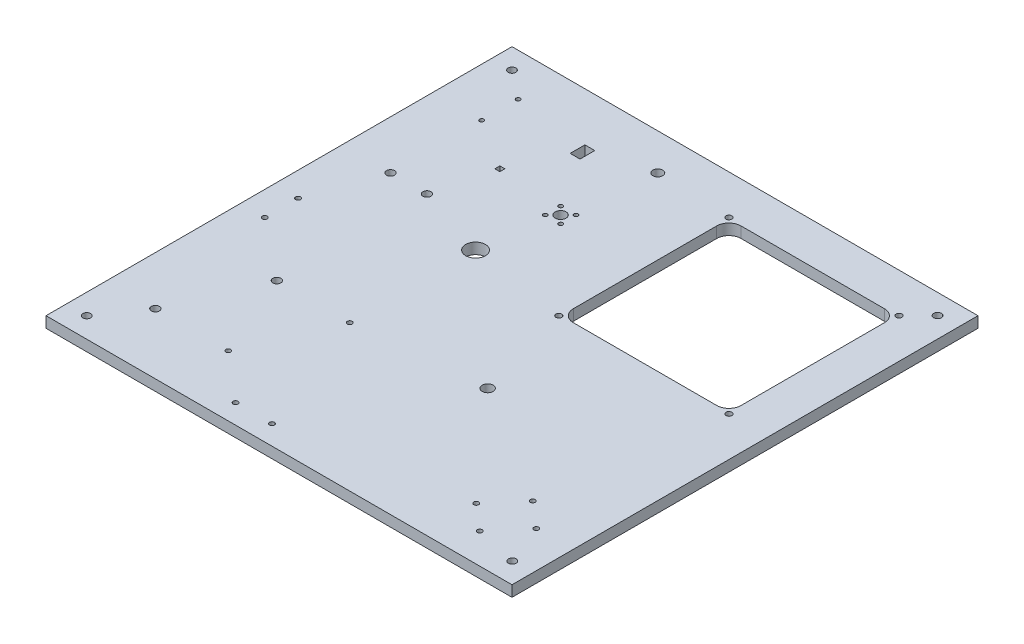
ISO-10303-21;
HEADER;
FILE_DESCRIPTION(('STEP AP214'),'2;1');
FILE_NAME('part.step','',(''),(''),'','','');
FILE_SCHEMA(('AUTOMOTIVE_DESIGN { 1 0 10303 214 1 1 1 1 }'));
ENDSEC;
DATA;
#1=APPLICATION_CONTEXT('core data for automotive mechanical design processes');
#2=APPLICATION_PROTOCOL_DEFINITION('international standard','automotive_design',2000,#1);
#3=PRODUCT_CONTEXT('',#1,'mechanical');
#4=PRODUCT('Part','Part','',(#3));
#5=PRODUCT_RELATED_PRODUCT_CATEGORY('part','',(#4));
#6=PRODUCT_DEFINITION_FORMATION('','',#4);
#7=PRODUCT_DEFINITION_CONTEXT('part definition',#1,'design');
#8=PRODUCT_DEFINITION('design','',#6,#7);
#9=PRODUCT_DEFINITION_SHAPE('','',#8);
#10=(LENGTH_UNIT() NAMED_UNIT(*) SI_UNIT(.MILLI.,.METRE.));
#11=(NAMED_UNIT(*) PLANE_ANGLE_UNIT() SI_UNIT($,.RADIAN.));
#12=(NAMED_UNIT(*) SI_UNIT($,.STERADIAN.) SOLID_ANGLE_UNIT());
#13=UNCERTAINTY_MEASURE_WITH_UNIT(LENGTH_MEASURE(1.E-05),#10,'distance_accuracy_value','');
#14=(GEOMETRIC_REPRESENTATION_CONTEXT(3) GLOBAL_UNCERTAINTY_ASSIGNED_CONTEXT((#13)) GLOBAL_UNIT_ASSIGNED_CONTEXT((#10,
#11,#12)) REPRESENTATION_CONTEXT('',''));
#15=CARTESIAN_POINT('',(0.,0.,0.));
#16=DIRECTION('',(0.,0.,1.));
#17=DIRECTION('',(1.,0.,0.));
#18=AXIS2_PLACEMENT_3D('',#15,#16,#17);
#19=CARTESIAN_POINT('',(0.,0.,0.));
#20=DIRECTION('',(0.,-1.,0.));
#21=DIRECTION('',(0.,0.,-1.));
#22=AXIS2_PLACEMENT_3D('',#19,#20,#21);
#23=PLANE('',#22);
#24=CARTESIAN_POINT('',(30.25,0.,-148.25));
#25=DIRECTION('',(0.,1.,0.));
#26=DIRECTION('',(0.,0.,-1.));
#27=AXIS2_PLACEMENT_3D('',#24,#25,#26);
#28=CIRCLE('',#27,10.);
#29=CARTESIAN_POINT('',(30.25,0.,-158.25));
#30=VERTEX_POINT('',#29);
#31=CARTESIAN_POINT('',(20.25,0.,-148.25));
#32=VERTEX_POINT('',#31);
#33=EDGE_CURVE('E177',#30,#32,#28,.T.);
#34=ORIENTED_EDGE('',*,*,#33,.T.);
#35=DIRECTION('',(0.,0.,1.));
#36=VECTOR('',#35,1.);
#37=CARTESIAN_POINT('',(20.25,0.,-30.25));
#38=LINE('',#37,#36);
#39=CARTESIAN_POINT('',(20.25,0.,-30.25));
#40=VERTEX_POINT('',#39);
#41=EDGE_CURVE('E186',#32,#40,#38,.T.);
#42=ORIENTED_EDGE('',*,*,#41,.T.);
#43=CARTESIAN_POINT('',(30.25,0.,-30.25));
#44=DIRECTION('',(0.,1.,0.));
#45=DIRECTION('',(0.,0.,-1.));
#46=AXIS2_PLACEMENT_3D('',#43,#44,#45);
#47=CIRCLE('',#46,10.);
#48=CARTESIAN_POINT('',(30.25,0.,-20.25));
#49=VERTEX_POINT('',#48);
#50=EDGE_CURVE('E53',#40,#49,#47,.T.);
#51=ORIENTED_EDGE('',*,*,#50,.T.);
#52=DIRECTION('',(1.,0.,0.));
#53=VECTOR('',#52,1.);
#54=CARTESIAN_POINT('',(30.25,0.,-20.25));
#55=LINE('',#54,#53);
#56=CARTESIAN_POINT('',(148.25,0.,-20.25));
#57=VERTEX_POINT('',#56);
#58=EDGE_CURVE('E200',#49,#57,#55,.T.);
#59=ORIENTED_EDGE('',*,*,#58,.T.);
#60=CARTESIAN_POINT('',(148.25,0.,-30.25));
#61=DIRECTION('',(0.,1.,0.));
#62=DIRECTION('',(0.,0.,-1.));
#63=AXIS2_PLACEMENT_3D('',#60,#61,#62);
#64=CIRCLE('',#63,10.);
#65=CARTESIAN_POINT('',(158.25,0.,-30.25));
#66=VERTEX_POINT('',#65);
#67=EDGE_CURVE('E203',#57,#66,#64,.T.);
#68=ORIENTED_EDGE('',*,*,#67,.T.);
#69=DIRECTION('',(0.,0.,-1.));
#70=VECTOR('',#69,1.);
#71=CARTESIAN_POINT('',(158.25,0.,-30.25));
#72=LINE('',#71,#70);
#73=CARTESIAN_POINT('',(158.25,0.,-148.25));
#74=VERTEX_POINT('',#73);
#75=EDGE_CURVE('E206',#66,#74,#72,.T.);
#76=ORIENTED_EDGE('',*,*,#75,.T.);
#77=CARTESIAN_POINT('',(148.25,0.,-148.25));
#78=DIRECTION('',(0.,1.,0.));
#79=DIRECTION('',(0.,0.,-1.));
#80=AXIS2_PLACEMENT_3D('',#77,#78,#79);
#81=CIRCLE('',#80,10.);
#82=CARTESIAN_POINT('',(148.25,0.,-158.25));
#83=VERTEX_POINT('',#82);
#84=EDGE_CURVE('E209',#74,#83,#81,.T.);
#85=ORIENTED_EDGE('',*,*,#84,.T.);
#86=DIRECTION('',(-1.,0.,0.));
#87=VECTOR('',#86,1.);
#88=CARTESIAN_POINT('',(30.25,0.,-158.25));
#89=LINE('',#88,#87);
#90=EDGE_CURVE('E183',#83,#30,#89,.T.);
#91=ORIENTED_EDGE('',*,*,#90,.T.);
#92=EDGE_LOOP('',(#34,#42,#51,#59,#68,#76,#85,#91));
#93=FACE_BOUND('',#92,.T.);
#94=CARTESIAN_POINT('',(159.27,0.,-159.27));
#95=DIRECTION('',(0.,1.,0.));
#96=DIRECTION('',(0.,0.,1.));
#97=AXIS2_PLACEMENT_3D('',#94,#95,#96);
#98=CIRCLE('',#97,2.39999999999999);
#99=CARTESIAN_POINT('',(159.27,0.,-156.87));
#100=VERTEX_POINT('',#99);
#101=EDGE_CURVE('E245',#100,#100,#98,.T.);
#102=ORIENTED_EDGE('',*,*,#101,.T.);
#103=EDGE_LOOP('',(#102));
#104=FACE_BOUND('',#103,.T.);
#105=CARTESIAN_POINT('',(19.27,0.,-159.27));
#106=DIRECTION('',(0.,1.,0.));
#107=DIRECTION('',(0.,0.,1.));
#108=AXIS2_PLACEMENT_3D('',#105,#106,#107);
#109=CIRCLE('',#108,2.4);
#110=CARTESIAN_POINT('',(19.27,0.,-156.87));
#111=VERTEX_POINT('',#110);
#112=EDGE_CURVE('E251',#111,#111,#109,.T.);
#113=ORIENTED_EDGE('',*,*,#112,.T.);
#114=EDGE_LOOP('',(#113));
#115=FACE_BOUND('',#114,.T.);
#116=CARTESIAN_POINT('',(19.27,0.,-19.27));
#117=DIRECTION('',(0.,1.,0.));
#118=DIRECTION('',(0.,0.,1.));
#119=AXIS2_PLACEMENT_3D('',#116,#117,#118);
#120=CIRCLE('',#119,2.4);
#121=CARTESIAN_POINT('',(19.27,0.,-16.87));
#122=VERTEX_POINT('',#121);
#123=EDGE_CURVE('E257',#122,#122,#120,.T.);
#124=ORIENTED_EDGE('',*,*,#123,.T.);
#125=EDGE_LOOP('',(#124));
#126=FACE_BOUND('',#125,.T.);
#127=CARTESIAN_POINT('',(159.27,0.,-19.27));
#128=DIRECTION('',(0.,1.,0.));
#129=DIRECTION('',(0.,0.,1.));
#130=AXIS2_PLACEMENT_3D('',#127,#128,#129);
#131=CIRCLE('',#130,2.39999999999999);
#132=CARTESIAN_POINT('',(159.27,0.,-16.87));
#133=VERTEX_POINT('',#132);
#134=EDGE_CURVE('E263',#133,#133,#131,.T.);
#135=ORIENTED_EDGE('',*,*,#134,.T.);
#136=EDGE_LOOP('',(#135));
#137=FACE_BOUND('',#136,.T.);
#138=CARTESIAN_POINT('',(-61.77,0.,-31.77));
#139=DIRECTION('',(0.,1.,0.));
#140=DIRECTION('',(0.,0.,1.));
#141=AXIS2_PLACEMENT_3D('',#138,#139,#140);
#142=CIRCLE('',#141,8.1);
#143=CARTESIAN_POINT('',(-61.77,0.,-23.67));
#144=VERTEX_POINT('',#143);
#145=EDGE_CURVE('E267',#144,#144,#142,.T.);
#146=ORIENTED_EDGE('',*,*,#145,.T.);
#147=EDGE_LOOP('',(#146));
#148=FACE_BOUND('',#147,.T.);
#149=CARTESIAN_POINT('',(-41.77,0.,-161.77));
#150=DIRECTION('',(0.,1.,0.));
#151=DIRECTION('',(0.,0.,1.));
#152=AXIS2_PLACEMENT_3D('',#149,#150,#151);
#153=CIRCLE('',#152,4.06);
#154=CARTESIAN_POINT('',(-41.77,0.,-157.71));
#155=VERTEX_POINT('',#154);
#156=EDGE_CURVE('E274',#155,#155,#153,.T.);
#157=ORIENTED_EDGE('',*,*,#156,.T.);
#158=EDGE_LOOP('',(#157));
#159=FACE_BOUND('',#158,.T.);
#160=DIRECTION('',(-1.,0.,0.));
#161=VECTOR('',#160,1.);
#162=CARTESIAN_POINT('',(-83.65,0.,-151.77));
#163=LINE('',#162,#161);
#164=CARTESIAN_POINT('',(-83.65,0.,-151.77));
#165=VERTEX_POINT('',#164);
#166=CARTESIAN_POINT('',(-91.77,0.,-151.77));
#167=VERTEX_POINT('',#166);
#168=EDGE_CURVE('E281',#165,#167,#163,.T.);
#169=ORIENTED_EDGE('',*,*,#168,.T.);
#170=DIRECTION('',(0.,0.,1.));
#171=VECTOR('',#170,1.);
#172=CARTESIAN_POINT('',(-91.77,0.,-151.77));
#173=LINE('',#172,#171);
#174=CARTESIAN_POINT('',(-91.77,0.,-139.63));
#175=VERTEX_POINT('',#174);
#176=EDGE_CURVE('E284',#167,#175,#173,.T.);
#177=ORIENTED_EDGE('',*,*,#176,.T.);
#178=DIRECTION('',(1.,0.,0.));
#179=VECTOR('',#178,1.);
#180=CARTESIAN_POINT('',(-91.77,0.,-139.63));
#181=LINE('',#180,#179);
#182=CARTESIAN_POINT('',(-83.65,0.,-139.63));
#183=VERTEX_POINT('',#182);
#184=EDGE_CURVE('E288',#175,#183,#181,.T.);
#185=ORIENTED_EDGE('',*,*,#184,.T.);
#186=DIRECTION('',(0.,0.,-1.));
#187=VECTOR('',#186,1.);
#188=CARTESIAN_POINT('',(-83.65,0.,-139.63));
#189=LINE('',#188,#187);
#190=EDGE_CURVE('E291',#183,#165,#189,.T.);
#191=ORIENTED_EDGE('',*,*,#190,.T.);
#192=EDGE_LOOP('',(#169,#177,#185,#191));
#193=FACE_BOUND('',#192,.T.);
#194=DIRECTION('',(-1.,0.,0.));
#195=VECTOR('',#194,1.);
#196=CARTESIAN_POINT('',(-107.65,0.,-101.77));
#197=LINE('',#196,#195);
#198=CARTESIAN_POINT('',(-107.65,0.,-101.77));
#199=VERTEX_POINT('',#198);
#200=CARTESIAN_POINT('',(-111.77,0.,-101.77));
#201=VERTEX_POINT('',#200);
#202=EDGE_CURVE('E313',#199,#201,#197,.T.);
#203=ORIENTED_EDGE('',*,*,#202,.T.);
#204=DIRECTION('',(0.,0.,1.));
#205=VECTOR('',#204,1.);
#206=CARTESIAN_POINT('',(-111.77,0.,-101.77));
#207=LINE('',#206,#205);
#208=CARTESIAN_POINT('',(-111.77,0.,-97.65));
#209=VERTEX_POINT('',#208);
#210=EDGE_CURVE('E316',#201,#209,#207,.T.);
#211=ORIENTED_EDGE('',*,*,#210,.T.);
#212=DIRECTION('',(1.,0.,0.));
#213=VECTOR('',#212,1.);
#214=CARTESIAN_POINT('',(-111.77,0.,-97.65));
#215=LINE('',#214,#213);
#216=CARTESIAN_POINT('',(-107.65,0.,-97.65));
#217=VERTEX_POINT('',#216);
#218=EDGE_CURVE('E320',#209,#217,#215,.T.);
#219=ORIENTED_EDGE('',*,*,#218,.T.);
#220=DIRECTION('',(0.,0.,-1.));
#221=VECTOR('',#220,1.);
#222=CARTESIAN_POINT('',(-107.65,0.,-97.65));
#223=LINE('',#222,#221);
#224=EDGE_CURVE('E323',#217,#199,#223,.T.);
#225=ORIENTED_EDGE('',*,*,#224,.T.);
#226=EDGE_LOOP('',(#203,#211,#219,#225));
#227=FACE_BOUND('',#226,.T.);
#228=CARTESIAN_POINT('',(-51.77,0.,-91.77));
#229=DIRECTION('',(0.,1.,0.));
#230=DIRECTION('',(0.,0.,1.));
#231=AXIS2_PLACEMENT_3D('',#228,#229,#230);
#232=CIRCLE('',#231,4.5);
#233=CARTESIAN_POINT('',(-51.77,0.,-87.27));
#234=VERTEX_POINT('',#233);
#235=EDGE_CURVE('E330',#234,#234,#232,.T.);
#236=ORIENTED_EDGE('',*,*,#235,.T.);
#237=EDGE_LOOP('',(#236));
#238=FACE_BOUND('',#237,.T.);
#239=CARTESIAN_POINT('',(-151.77,0.,-156.77));
#240=DIRECTION('',(0.,-1.,0.));
#241=DIRECTION('',(0.,0.,-1.));
#242=AXIS2_PLACEMENT_3D('',#239,#240,#241);
#243=CIRCLE('',#242,1.69733715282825);
#244=CARTESIAN_POINT('',(-151.77,0.,-158.467337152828));
#245=VERTEX_POINT('',#244);
#246=EDGE_CURVE('E40',#245,#245,#243,.T.);
#247=ORIENTED_EDGE('',*,*,#246,.F.);
#248=EDGE_LOOP('',(#247));
#249=FACE_BOUND('',#248,.T.);
#250=CARTESIAN_POINT('',(-151.77,0.,-126.77));
#251=DIRECTION('',(0.,-1.,0.));
#252=DIRECTION('',(0.,0.,-1.));
#253=AXIS2_PLACEMENT_3D('',#250,#251,#252);
#254=CIRCLE('',#253,1.69733715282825);
#255=CARTESIAN_POINT('',(-151.77,0.,-128.467337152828));
#256=VERTEX_POINT('',#255);
#257=EDGE_CURVE('E360',#256,#256,#254,.T.);
#258=ORIENTED_EDGE('',*,*,#257,.F.);
#259=EDGE_LOOP('',(#258));
#260=FACE_BOUND('',#259,.T.);
#261=CARTESIAN_POINT('',(-58.09,0.,-85.44));
#262=DIRECTION('',(0.,-1.,0.));
#263=DIRECTION('',(0.,0.,-1.));
#264=AXIS2_PLACEMENT_3D('',#261,#262,#263);
#265=CIRCLE('',#264,1.69733715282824);
#266=CARTESIAN_POINT('',(-58.09,0.,-87.1373371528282));
#267=VERTEX_POINT('',#266);
#268=EDGE_CURVE('E367',#267,#267,#265,.T.);
#269=ORIENTED_EDGE('',*,*,#268,.F.);
#270=EDGE_LOOP('',(#269));
#271=FACE_BOUND('',#270,.T.);
#272=CARTESIAN_POINT('',(-45.44,0.,-85.44));
#273=DIRECTION('',(0.,-1.,0.));
#274=DIRECTION('',(0.,0.,-1.));
#275=AXIS2_PLACEMENT_3D('',#272,#273,#274);
#276=CIRCLE('',#275,1.69733715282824);
#277=CARTESIAN_POINT('',(-45.44,0.,-87.1373371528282));
#278=VERTEX_POINT('',#277);
#279=EDGE_CURVE('E374',#278,#278,#276,.T.);
#280=ORIENTED_EDGE('',*,*,#279,.F.);
#281=EDGE_LOOP('',(#280));
#282=FACE_BOUND('',#281,.T.);
#283=CARTESIAN_POINT('',(-45.44,0.,-98.09));
#284=DIRECTION('',(0.,-1.,0.));
#285=DIRECTION('',(0.,0.,-1.));
#286=AXIS2_PLACEMENT_3D('',#283,#284,#285);
#287=CIRCLE('',#286,1.69733715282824);
#288=CARTESIAN_POINT('',(-45.44,0.,-99.7873371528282));
#289=VERTEX_POINT('',#288);
#290=EDGE_CURVE('E381',#289,#289,#287,.T.);
#291=ORIENTED_EDGE('',*,*,#290,.F.);
#292=EDGE_LOOP('',(#291));
#293=FACE_BOUND('',#292,.T.);
#294=CARTESIAN_POINT('',(-58.09,0.,-98.09));
#295=DIRECTION('',(0.,-1.,0.));
#296=DIRECTION('',(0.,0.,-1.));
#297=AXIS2_PLACEMENT_3D('',#294,#295,#296);
#298=CIRCLE('',#297,1.69733715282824);
#299=CARTESIAN_POINT('',(-58.09,0.,-99.7873371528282));
#300=VERTEX_POINT('',#299);
#301=EDGE_CURVE('E388',#300,#300,#298,.T.);
#302=ORIENTED_EDGE('',*,*,#301,.F.);
#303=EDGE_LOOP('',(#302));
#304=FACE_BOUND('',#303,.T.);
#305=CARTESIAN_POINT('',(41.77,0.,61.77));
#306=DIRECTION('',(0.,-1.,0.));
#307=DIRECTION('',(0.,0.,-1.));
#308=AXIS2_PLACEMENT_3D('',#305,#306,#307);
#309=CIRCLE('',#308,4.49733715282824);
#310=CARTESIAN_POINT('',(41.77,0.,57.2726628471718));
#311=VERTEX_POINT('',#310);
#312=EDGE_CURVE('E395',#311,#311,#309,.T.);
#313=ORIENTED_EDGE('',*,*,#312,.F.);
#314=EDGE_LOOP('',(#313));
#315=FACE_BOUND('',#314,.T.);
#316=CARTESIAN_POINT('',(-151.77,0.,141.77));
#317=DIRECTION('',(0.,-1.,0.));
#318=DIRECTION('',(0.,0.,-1.));
#319=AXIS2_PLACEMENT_3D('',#316,#317,#318);
#320=CIRCLE('',#319,3.29733715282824);
#321=CARTESIAN_POINT('',(-151.77,0.,138.472662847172));
#322=VERTEX_POINT('',#321);
#323=EDGE_CURVE('E402',#322,#322,#320,.T.);
#324=ORIENTED_EDGE('',*,*,#323,.F.);
#325=EDGE_LOOP('',(#324));
#326=FACE_BOUND('',#325,.T.);
#327=CARTESIAN_POINT('',(-121.77,0.,71.77));
#328=DIRECTION('',(0.,-1.,0.));
#329=DIRECTION('',(0.,0.,-1.));
#330=AXIS2_PLACEMENT_3D('',#327,#328,#329);
#331=CIRCLE('',#330,3.29733715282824);
#332=CARTESIAN_POINT('',(-121.77,0.,68.4726628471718));
#333=VERTEX_POINT('',#332);
#334=EDGE_CURVE('E409',#333,#333,#331,.T.);
#335=ORIENTED_EDGE('',*,*,#334,.F.);
#336=EDGE_LOOP('',(#335));
#337=FACE_BOUND('',#336,.T.);
#338=CARTESIAN_POINT('',(-151.77,0.,-51.77));
#339=DIRECTION('',(0.,-1.,0.));
#340=DIRECTION('',(0.,0.,-1.));
#341=AXIS2_PLACEMENT_3D('',#338,#339,#340);
#342=CIRCLE('',#341,3.29733715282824);
#343=CARTESIAN_POINT('',(-151.77,0.,-55.0673371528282));
#344=VERTEX_POINT('',#343);
#345=EDGE_CURVE('E416',#344,#344,#342,.T.);
#346=ORIENTED_EDGE('',*,*,#345,.F.);
#347=EDGE_LOOP('',(#346));
#348=FACE_BOUND('',#347,.T.);
#349=CARTESIAN_POINT('',(-121.77,0.,-51.77));
#350=DIRECTION('',(0.,-1.,0.));
#351=DIRECTION('',(0.,0.,-1.));
#352=AXIS2_PLACEMENT_3D('',#349,#350,#351);
#353=CIRCLE('',#352,3.29733715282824);
#354=CARTESIAN_POINT('',(-121.77,0.,-55.0673371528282));
#355=VERTEX_POINT('',#354);
#356=EDGE_CURVE('E423',#355,#355,#353,.T.);
#357=ORIENTED_EDGE('',*,*,#356,.F.);
#358=EDGE_LOOP('',(#357));
#359=FACE_BOUND('',#358,.T.);
#360=CARTESIAN_POINT('',(-51.77,0.,175.77));
#361=DIRECTION('',(0.,-1.,0.));
#362=DIRECTION('',(0.,0.,-1.));
#363=AXIS2_PLACEMENT_3D('',#360,#361,#362);
#364=CIRCLE('',#363,1.99733715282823);
#365=CARTESIAN_POINT('',(-51.77,0.,173.772662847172));
#366=VERTEX_POINT('',#365);
#367=EDGE_CURVE('E430',#366,#366,#364,.T.);
#368=ORIENTED_EDGE('',*,*,#367,.F.);
#369=EDGE_LOOP('',(#368));
#370=FACE_BOUND('',#369,.T.);
#371=CARTESIAN_POINT('',(-21.77,0.,175.77));
#372=DIRECTION('',(0.,-1.,0.));
#373=DIRECTION('',(0.,0.,-1.));
#374=AXIS2_PLACEMENT_3D('',#371,#372,#373);
#375=CIRCLE('',#374,1.99733715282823);
#376=CARTESIAN_POINT('',(-21.77,0.,173.772662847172));
#377=VERTEX_POINT('',#376);
#378=EDGE_CURVE('E437',#377,#377,#375,.T.);
#379=ORIENTED_EDGE('',*,*,#378,.F.);
#380=EDGE_LOOP('',(#379));
#381=FACE_BOUND('',#380,.T.);
#382=CARTESIAN_POINT('',(-91.77,0.,141.77));
#383=DIRECTION('',(0.,-1.,0.));
#384=DIRECTION('',(0.,0.,-1.));
#385=AXIS2_PLACEMENT_3D('',#382,#383,#384);
#386=CIRCLE('',#385,1.99733715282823);
#387=CARTESIAN_POINT('',(-91.77,0.,139.772662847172));
#388=VERTEX_POINT('',#387);
#389=EDGE_CURVE('E444',#388,#388,#386,.T.);
#390=ORIENTED_EDGE('',*,*,#389,.F.);
#391=EDGE_LOOP('',(#390));
#392=FACE_BOUND('',#391,.T.);
#393=CARTESIAN_POINT('',(-61.77,0.,71.77));
#394=DIRECTION('',(0.,-1.,0.));
#395=DIRECTION('',(0.,0.,-1.));
#396=AXIS2_PLACEMENT_3D('',#393,#394,#395);
#397=CIRCLE('',#396,1.99733715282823);
#398=CARTESIAN_POINT('',(-61.77,0.,69.7726628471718));
#399=VERTEX_POINT('',#398);
#400=EDGE_CURVE('E451',#399,#399,#397,.T.);
#401=ORIENTED_EDGE('',*,*,#400,.F.);
#402=EDGE_LOOP('',(#401));
#403=FACE_BOUND('',#402,.T.);
#404=CARTESIAN_POINT('',(-171.77,0.,31.77));
#405=DIRECTION('',(0.,-1.,0.));
#406=DIRECTION('',(0.,0.,-1.));
#407=AXIS2_PLACEMENT_3D('',#404,#405,#406);
#408=CIRCLE('',#407,1.99733715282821);
#409=CARTESIAN_POINT('',(-171.77,0.,29.7726628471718));
#410=VERTEX_POINT('',#409);
#411=EDGE_CURVE('E458',#410,#410,#408,.T.);
#412=ORIENTED_EDGE('',*,*,#411,.F.);
#413=EDGE_LOOP('',(#412));
#414=FACE_BOUND('',#413,.T.);
#415=CARTESIAN_POINT('',(-171.77,0.,4.338));
#416=DIRECTION('',(0.,-1.,0.));
#417=DIRECTION('',(0.,0.,-1.));
#418=AXIS2_PLACEMENT_3D('',#415,#416,#417);
#419=CIRCLE('',#418,1.99733715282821);
#420=CARTESIAN_POINT('',(-171.77,0.,2.34066284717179));
#421=VERTEX_POINT('',#420);
#422=EDGE_CURVE('E465',#421,#421,#419,.T.);
#423=ORIENTED_EDGE('',*,*,#422,.F.);
#424=EDGE_LOOP('',(#423));
#425=FACE_BOUND('',#424,.T.);
#426=CARTESIAN_POINT('',(140.229340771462,0.,166.77));
#427=DIRECTION('',(0.,-1.,0.));
#428=DIRECTION('',(0.,0.,-1.));
#429=AXIS2_PLACEMENT_3D('',#426,#427,#428);
#430=CIRCLE('',#429,1.99733715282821);
#431=CARTESIAN_POINT('',(140.229340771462,0.,164.772662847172));
#432=VERTEX_POINT('',#431);
#433=EDGE_CURVE('E472',#432,#432,#430,.T.);
#434=ORIENTED_EDGE('',*,*,#433,.F.);
#435=EDGE_LOOP('',(#434));
#436=FACE_BOUND('',#435,.T.);
#437=CARTESIAN_POINT('',(161.77,0.,141.77));
#438=DIRECTION('',(0.,-1.,0.));
#439=DIRECTION('',(0.,0.,-1.));
#440=AXIS2_PLACEMENT_3D('',#437,#438,#439);
#441=CIRCLE('',#440,1.99733715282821);
#442=CARTESIAN_POINT('',(161.77,0.,139.772662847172));
#443=VERTEX_POINT('',#442);
#444=EDGE_CURVE('E479',#443,#443,#441,.T.);
#445=ORIENTED_EDGE('',*,*,#444,.F.);
#446=EDGE_LOOP('',(#445));
#447=FACE_BOUND('',#446,.T.);
#448=CARTESIAN_POINT('',(140.577784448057,0.,123.47));
#449=DIRECTION('',(0.,-1.,0.));
#450=DIRECTION('',(0.,0.,-1.));
#451=AXIS2_PLACEMENT_3D('',#448,#449,#450);
#452=CIRCLE('',#451,1.99733715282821);
#453=CARTESIAN_POINT('',(140.577784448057,0.,121.472662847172));
#454=VERTEX_POINT('',#453);
#455=EDGE_CURVE('E486',#454,#454,#452,.T.);
#456=ORIENTED_EDGE('',*,*,#455,.F.);
#457=EDGE_LOOP('',(#456));
#458=FACE_BOUND('',#457,.T.);
#459=CARTESIAN_POINT('',(119.037125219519,0.,148.47));
#460=DIRECTION('',(0.,-1.,0.));
#461=DIRECTION('',(0.,0.,-1.));
#462=AXIS2_PLACEMENT_3D('',#459,#460,#461);
#463=CIRCLE('',#462,1.99733715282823);
#464=CARTESIAN_POINT('',(119.037125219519,0.,146.472662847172));
#465=VERTEX_POINT('',#464);
#466=EDGE_CURVE('E493',#465,#465,#463,.T.);
#467=ORIENTED_EDGE('',*,*,#466,.F.);
#468=EDGE_LOOP('',(#467));
#469=FACE_BOUND('',#468,.T.);
#470=CARTESIAN_POINT('',(-175.,0.,175.));
#471=DIRECTION('',(0.,1.,0.));
#472=DIRECTION('',(0.,0.,1.));
#473=AXIS2_PLACEMENT_3D('',#470,#471,#472);
#474=CIRCLE('',#473,3.17500000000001);
#475=CARTESIAN_POINT('',(-175.,0.,178.175));
#476=VERTEX_POINT('',#475);
#477=EDGE_CURVE('E497',#476,#476,#474,.T.);
#478=ORIENTED_EDGE('',*,*,#477,.T.);
#479=EDGE_LOOP('',(#478));
#480=FACE_BOUND('',#479,.T.);
#481=CARTESIAN_POINT('',(-175.,0.,-175.));
#482=DIRECTION('',(0.,1.,0.));
#483=DIRECTION('',(0.,0.,1.));
#484=AXIS2_PLACEMENT_3D('',#481,#482,#483);
#485=CIRCLE('',#484,3.17500000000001);
#486=CARTESIAN_POINT('',(-175.,0.,-171.825));
#487=VERTEX_POINT('',#486);
#488=EDGE_CURVE('E503',#487,#487,#485,.T.);
#489=ORIENTED_EDGE('',*,*,#488,.T.);
#490=EDGE_LOOP('',(#489));
#491=FACE_BOUND('',#490,.T.);
#492=CARTESIAN_POINT('',(175.,0.,-175.23));
#493=DIRECTION('',(0.,1.,0.));
#494=DIRECTION('',(0.,0.,1.));
#495=AXIS2_PLACEMENT_3D('',#492,#493,#494);
#496=CIRCLE('',#495,3.17500000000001);
#497=CARTESIAN_POINT('',(175.,0.,-172.055));
#498=VERTEX_POINT('',#497);
#499=EDGE_CURVE('E509',#498,#498,#496,.T.);
#500=ORIENTED_EDGE('',*,*,#499,.T.);
#501=EDGE_LOOP('',(#500));
#502=FACE_BOUND('',#501,.T.);
#503=CARTESIAN_POINT('',(175.,0.,174.77));
#504=DIRECTION('',(0.,1.,0.));
#505=DIRECTION('',(0.,0.,1.));
#506=AXIS2_PLACEMENT_3D('',#503,#504,#505);
#507=CIRCLE('',#506,3.17500000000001);
#508=CARTESIAN_POINT('',(175.,0.,177.945));
#509=VERTEX_POINT('',#508);
#510=EDGE_CURVE('E515',#509,#509,#507,.T.);
#511=ORIENTED_EDGE('',*,*,#510,.T.);
#512=EDGE_LOOP('',(#511));
#513=FACE_BOUND('',#512,.T.);
#514=DIRECTION('',(0.,0.,-1.));
#515=VECTOR('',#514,1.);
#516=CARTESIAN_POINT('',(191.77,0.,191.77));
#517=LINE('',#516,#515);
#518=CARTESIAN_POINT('',(191.77,0.,191.77));
#519=VERTEX_POINT('',#518);
#520=CARTESIAN_POINT('',(191.77,0.,-191.77));
#521=VERTEX_POINT('',#520);
#522=EDGE_CURVE('E518',#519,#521,#517,.T.);
#523=ORIENTED_EDGE('',*,*,#522,.F.);
#524=DIRECTION('',(1.,0.,0.));
#525=VECTOR('',#524,1.);
#526=CARTESIAN_POINT('',(-191.77,0.,191.77));
#527=LINE('',#526,#525);
#528=CARTESIAN_POINT('',(-191.77,0.,191.77));
#529=VERTEX_POINT('',#528);
#530=EDGE_CURVE('E523',#529,#519,#527,.T.);
#531=ORIENTED_EDGE('',*,*,#530,.F.);
#532=DIRECTION('',(0.,0.,1.));
#533=VECTOR('',#532,1.);
#534=CARTESIAN_POINT('',(-191.77,0.,191.77));
#535=LINE('',#534,#533);
#536=CARTESIAN_POINT('',(-191.77,0.,-191.77));
#537=VERTEX_POINT('',#536);
#538=EDGE_CURVE('E534',#537,#529,#535,.T.);
#539=ORIENTED_EDGE('',*,*,#538,.F.);
#540=DIRECTION('',(-1.,0.,0.));
#541=VECTOR('',#540,1.);
#542=CARTESIAN_POINT('',(-191.77,0.,-191.77));
#543=LINE('',#542,#541);
#544=EDGE_CURVE('E532',#521,#537,#543,.T.);
#545=ORIENTED_EDGE('',*,*,#544,.F.);
#546=EDGE_LOOP('',(#523,#531,#539,#545));
#547=FACE_BOUND('',#546,.T.);
#548=ADVANCED_FACE('F36',(#93,#104,#115,#126,#137,#148,#159,#193,#227,#238,#249,#260,#271,#282,
#293,#304,#315,#326,#337,#348,#359,#370,#381,#392,#403,#414,#425,#436,#447,#458,#469,#480,#491,
#502,#513,#547),#23,.T.);
#549=CARTESIAN_POINT('',(191.77,8.9916,191.77));
#550=DIRECTION('',(-1.,0.,0.));
#551=DIRECTION('',(0.,0.,1.));
#552=AXIS2_PLACEMENT_3D('',#549,#550,#551);
#553=PLANE('',#552);
#554=ORIENTED_EDGE('',*,*,#522,.T.);
#555=DIRECTION('',(0.,-1.,0.));
#556=VECTOR('',#555,1.);
#557=CARTESIAN_POINT('',(191.77,8.9916,-191.77));
#558=LINE('',#557,#556);
#559=CARTESIAN_POINT('',(191.77,8.9916,-191.77));
#560=VERTEX_POINT('',#559);
#561=EDGE_CURVE('E11',#560,#521,#558,.T.);
#562=ORIENTED_EDGE('',*,*,#561,.F.);
#563=DIRECTION('',(0.,0.,-1.));
#564=VECTOR('',#563,1.);
#565=CARTESIAN_POINT('',(191.77,8.9916,191.77));
#566=LINE('',#565,#564);
#567=CARTESIAN_POINT('',(191.77,8.9916,191.77));
#568=VERTEX_POINT('',#567);
#569=EDGE_CURVE('E519',#568,#560,#566,.T.);
#570=ORIENTED_EDGE('',*,*,#569,.F.);
#571=DIRECTION('',(0.,-1.,0.));
#572=VECTOR('',#571,1.);
#573=CARTESIAN_POINT('',(191.77,8.9916,191.77));
#574=LINE('',#573,#572);
#575=EDGE_CURVE('E529',#568,#519,#574,.T.);
#576=ORIENTED_EDGE('',*,*,#575,.T.);
#577=EDGE_LOOP('',(#554,#562,#570,#576));
#578=FACE_BOUND('',#577,.T.);
#579=ADVANCED_FACE('F38',(#578),#553,.F.);
#580=CARTESIAN_POINT('',(-191.77,8.9916,-191.77));
#581=DIRECTION('',(0.,0.,1.));
#582=DIRECTION('',(1.,0.,0.));
#583=AXIS2_PLACEMENT_3D('',#580,#581,#582);
#584=PLANE('',#583);
#585=ORIENTED_EDGE('',*,*,#544,.T.);
#586=DIRECTION('',(0.,-1.,0.));
#587=VECTOR('',#586,1.);
#588=CARTESIAN_POINT('',(-191.77,8.9916,-191.77));
#589=LINE('',#588,#587);
#590=CARTESIAN_POINT('',(-191.77,8.9916,-191.77));
#591=VERTEX_POINT('',#590);
#592=EDGE_CURVE('E45',#591,#537,#589,.T.);
#593=ORIENTED_EDGE('',*,*,#592,.F.);
#594=DIRECTION('',(-1.,0.,0.));
#595=VECTOR('',#594,1.);
#596=CARTESIAN_POINT('',(-191.77,8.9916,-191.77));
#597=LINE('',#596,#595);
#598=EDGE_CURVE('E522',#560,#591,#597,.T.);
#599=ORIENTED_EDGE('',*,*,#598,.F.);
#600=ORIENTED_EDGE('',*,*,#561,.T.);
#601=EDGE_LOOP('',(#585,#593,#599,#600));
#602=FACE_BOUND('',#601,.T.);
#603=ADVANCED_FACE('F652',(#602),#584,.F.);
#604=CARTESIAN_POINT('',(-191.77,8.9916,191.77));
#605=DIRECTION('',(1.,0.,0.));
#606=DIRECTION('',(0.,0.,-1.));
#607=AXIS2_PLACEMENT_3D('',#604,#605,#606);
#608=PLANE('',#607);
#609=ORIENTED_EDGE('',*,*,#538,.T.);
#610=DIRECTION('',(0.,-1.,0.));
#611=VECTOR('',#610,1.);
#612=CARTESIAN_POINT('',(-191.77,8.9916,191.77));
#613=LINE('',#612,#611);
#614=CARTESIAN_POINT('',(-191.77,8.9916,191.77));
#615=VERTEX_POINT('',#614);
#616=EDGE_CURVE('E539',#615,#529,#613,.T.);
#617=ORIENTED_EDGE('',*,*,#616,.F.);
#618=DIRECTION('',(0.,0.,1.));
#619=VECTOR('',#618,1.);
#620=CARTESIAN_POINT('',(-191.77,8.9916,191.77));
#621=LINE('',#620,#619);
#622=EDGE_CURVE('E525',#591,#615,#621,.T.);
#623=ORIENTED_EDGE('',*,*,#622,.F.);
#624=ORIENTED_EDGE('',*,*,#592,.T.);
#625=EDGE_LOOP('',(#609,#617,#623,#624));
#626=FACE_BOUND('',#625,.T.);
#627=ADVANCED_FACE('F649',(#626),#608,.F.);
#628=CARTESIAN_POINT('',(-191.77,8.9916,191.77));
#629=DIRECTION('',(0.,0.,-1.));
#630=DIRECTION('',(-1.,0.,0.));
#631=AXIS2_PLACEMENT_3D('',#628,#629,#630);
#632=PLANE('',#631);
#633=ORIENTED_EDGE('',*,*,#530,.T.);
#634=ORIENTED_EDGE('',*,*,#575,.F.);
#635=DIRECTION('',(1.,0.,0.));
#636=VECTOR('',#635,1.);
#637=CARTESIAN_POINT('',(-191.77,8.9916,191.77));
#638=LINE('',#637,#636);
#639=EDGE_CURVE('E527',#615,#568,#638,.T.);
#640=ORIENTED_EDGE('',*,*,#639,.F.);
#641=ORIENTED_EDGE('',*,*,#616,.T.);
#642=EDGE_LOOP('',(#633,#634,#640,#641));
#643=FACE_BOUND('',#642,.T.);
#644=ADVANCED_FACE('F645',(#643),#632,.F.);
#645=CARTESIAN_POINT('',(0.,8.9916,0.));
#646=DIRECTION('',(0.,-1.,0.));
#647=DIRECTION('',(0.,0.,-1.));
#648=AXIS2_PLACEMENT_3D('',#645,#646,#647);
#649=PLANE('',#648);
#650=DIRECTION('',(0.,0.,1.));
#651=VECTOR('',#650,1.);
#652=CARTESIAN_POINT('',(20.25,8.9916,-30.25));
#653=LINE('',#652,#651);
#654=CARTESIAN_POINT('',(20.25,8.9916,-148.25));
#655=VERTEX_POINT('',#654);
#656=CARTESIAN_POINT('',(20.25,8.9916,-30.25));
#657=VERTEX_POINT('',#656);
#658=EDGE_CURVE('E213',#655,#657,#653,.T.);
#659=ORIENTED_EDGE('',*,*,#658,.F.);
#660=CARTESIAN_POINT('',(30.25,8.9916,-148.25));
#661=DIRECTION('',(0.,1.,0.));
#662=DIRECTION('',(0.,0.,-1.));
#663=AXIS2_PLACEMENT_3D('',#660,#661,#662);
#664=CIRCLE('',#663,10.);
#665=CARTESIAN_POINT('',(30.25,8.9916,-158.25));
#666=VERTEX_POINT('',#665);
#667=EDGE_CURVE('E61',#666,#655,#664,.T.);
#668=ORIENTED_EDGE('',*,*,#667,.F.);
#669=DIRECTION('',(-1.,0.,0.));
#670=VECTOR('',#669,1.);
#671=CARTESIAN_POINT('',(30.25,8.9916,-158.25));
#672=LINE('',#671,#670);
#673=CARTESIAN_POINT('',(148.25,8.9916,-158.25));
#674=VERTEX_POINT('',#673);
#675=EDGE_CURVE('E193',#674,#666,#672,.T.);
#676=ORIENTED_EDGE('',*,*,#675,.F.);
#677=CARTESIAN_POINT('',(148.25,8.9916,-148.25));
#678=DIRECTION('',(0.,1.,0.));
#679=DIRECTION('',(0.,0.,-1.));
#680=AXIS2_PLACEMENT_3D('',#677,#678,#679);
#681=CIRCLE('',#680,10.);
#682=CARTESIAN_POINT('',(158.25,8.9916,-148.25));
#683=VERTEX_POINT('',#682);
#684=EDGE_CURVE('E196',#683,#674,#681,.T.);
#685=ORIENTED_EDGE('',*,*,#684,.F.);
#686=DIRECTION('',(0.,0.,-1.));
#687=VECTOR('',#686,1.);
#688=CARTESIAN_POINT('',(158.25,8.9916,-30.25));
#689=LINE('',#688,#687);
#690=CARTESIAN_POINT('',(158.25,8.9916,-30.25));
#691=VERTEX_POINT('',#690);
#692=EDGE_CURVE('E224',#691,#683,#689,.T.);
#693=ORIENTED_EDGE('',*,*,#692,.F.);
#694=CARTESIAN_POINT('',(148.25,8.9916,-30.25));
#695=DIRECTION('',(0.,1.,0.));
#696=DIRECTION('',(0.,0.,-1.));
#697=AXIS2_PLACEMENT_3D('',#694,#695,#696);
#698=CIRCLE('',#697,10.);
#699=CARTESIAN_POINT('',(148.25,8.9916,-20.25));
#700=VERTEX_POINT('',#699);
#701=EDGE_CURVE('E221',#700,#691,#698,.T.);
#702=ORIENTED_EDGE('',*,*,#701,.F.);
#703=DIRECTION('',(1.,0.,0.));
#704=VECTOR('',#703,1.);
#705=CARTESIAN_POINT('',(30.25,8.9916,-20.25));
#706=LINE('',#705,#704);
#707=CARTESIAN_POINT('',(30.25,8.9916,-20.25));
#708=VERTEX_POINT('',#707);
#709=EDGE_CURVE('E218',#708,#700,#706,.T.);
#710=ORIENTED_EDGE('',*,*,#709,.F.);
#711=CARTESIAN_POINT('',(30.25,8.9916,-30.25));
#712=DIRECTION('',(0.,1.,0.));
#713=DIRECTION('',(0.,0.,-1.));
#714=AXIS2_PLACEMENT_3D('',#711,#712,#713);
#715=CIRCLE('',#714,10.);
#716=EDGE_CURVE('E215',#657,#708,#715,.T.);
#717=ORIENTED_EDGE('',*,*,#716,.F.);
#718=EDGE_LOOP('',(#659,#668,#676,#685,#693,#702,#710,#717));
#719=FACE_BOUND('',#718,.T.);
#720=CARTESIAN_POINT('',(159.27,8.9916,-159.27));
#721=DIRECTION('',(0.,1.,0.));
#722=DIRECTION('',(0.,0.,1.));
#723=AXIS2_PLACEMENT_3D('',#720,#721,#722);
#724=CIRCLE('',#723,2.39999999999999);
#725=CARTESIAN_POINT('',(159.27,8.9916,-156.87));
#726=VERTEX_POINT('',#725);
#727=EDGE_CURVE('E231',#726,#726,#724,.T.);
#728=ORIENTED_EDGE('',*,*,#727,.F.);
#729=EDGE_LOOP('',(#728));
#730=FACE_BOUND('',#729,.T.);
#731=CARTESIAN_POINT('',(19.27,8.9916,-159.27));
#732=DIRECTION('',(0.,1.,0.));
#733=DIRECTION('',(0.,0.,1.));
#734=AXIS2_PLACEMENT_3D('',#731,#732,#733);
#735=CIRCLE('',#734,2.4);
#736=CARTESIAN_POINT('',(19.27,8.9916,-156.87));
#737=VERTEX_POINT('',#736);
#738=EDGE_CURVE('E248',#737,#737,#735,.T.);
#739=ORIENTED_EDGE('',*,*,#738,.F.);
#740=EDGE_LOOP('',(#739));
#741=FACE_BOUND('',#740,.T.);
#742=CARTESIAN_POINT('',(19.27,8.9916,-19.27));
#743=DIRECTION('',(0.,1.,0.));
#744=DIRECTION('',(0.,0.,1.));
#745=AXIS2_PLACEMENT_3D('',#742,#743,#744);
#746=CIRCLE('',#745,2.4);
#747=CARTESIAN_POINT('',(19.27,8.9916,-16.87));
#748=VERTEX_POINT('',#747);
#749=EDGE_CURVE('E254',#748,#748,#746,.T.);
#750=ORIENTED_EDGE('',*,*,#749,.F.);
#751=EDGE_LOOP('',(#750));
#752=FACE_BOUND('',#751,.T.);
#753=CARTESIAN_POINT('',(159.27,8.9916,-19.27));
#754=DIRECTION('',(0.,1.,0.));
#755=DIRECTION('',(0.,0.,1.));
#756=AXIS2_PLACEMENT_3D('',#753,#754,#755);
#757=CIRCLE('',#756,2.39999999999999);
#758=CARTESIAN_POINT('',(159.27,8.9916,-16.87));
#759=VERTEX_POINT('',#758);
#760=EDGE_CURVE('E260',#759,#759,#757,.T.);
#761=ORIENTED_EDGE('',*,*,#760,.F.);
#762=EDGE_LOOP('',(#761));
#763=FACE_BOUND('',#762,.T.);
#764=CARTESIAN_POINT('',(-61.77,8.9916,-31.77));
#765=DIRECTION('',(0.,1.,0.));
#766=DIRECTION('',(0.,0.,1.));
#767=AXIS2_PLACEMENT_3D('',#764,#765,#766);
#768=CIRCLE('',#767,8.1);
#769=CARTESIAN_POINT('',(-61.77,8.9916,-23.67));
#770=VERTEX_POINT('',#769);
#771=EDGE_CURVE('E271',#770,#770,#768,.T.);
#772=ORIENTED_EDGE('',*,*,#771,.F.);
#773=EDGE_LOOP('',(#772));
#774=FACE_BOUND('',#773,.T.);
#775=CARTESIAN_POINT('',(-41.77,8.9916,-161.77));
#776=DIRECTION('',(0.,1.,0.));
#777=DIRECTION('',(0.,0.,1.));
#778=AXIS2_PLACEMENT_3D('',#775,#776,#777);
#779=CIRCLE('',#778,4.06);
#780=CARTESIAN_POINT('',(-41.77,8.9916,-157.71));
#781=VERTEX_POINT('',#780);
#782=EDGE_CURVE('E277',#781,#781,#779,.T.);
#783=ORIENTED_EDGE('',*,*,#782,.F.);
#784=EDGE_LOOP('',(#783));
#785=FACE_BOUND('',#784,.T.);
#786=DIRECTION('',(0.,0.,1.));
#787=VECTOR('',#786,1.);
#788=CARTESIAN_POINT('',(-91.77,8.9916,-151.77));
#789=LINE('',#788,#787);
#790=CARTESIAN_POINT('',(-91.77,8.9916,-151.77));
#791=VERTEX_POINT('',#790);
#792=CARTESIAN_POINT('',(-91.77,8.9916,-139.63));
#793=VERTEX_POINT('',#792);
#794=EDGE_CURVE('E297',#791,#793,#789,.T.);
#795=ORIENTED_EDGE('',*,*,#794,.F.);
#796=DIRECTION('',(-1.,0.,0.));
#797=VECTOR('',#796,1.);
#798=CARTESIAN_POINT('',(-83.65,8.9916,-151.77));
#799=LINE('',#798,#797);
#800=CARTESIAN_POINT('',(-83.65,8.9916,-151.77));
#801=VERTEX_POINT('',#800);
#802=EDGE_CURVE('E295',#801,#791,#799,.T.);
#803=ORIENTED_EDGE('',*,*,#802,.F.);
#804=DIRECTION('',(0.,0.,-1.));
#805=VECTOR('',#804,1.);
#806=CARTESIAN_POINT('',(-83.65,8.9916,-139.63));
#807=LINE('',#806,#805);
#808=CARTESIAN_POINT('',(-83.65,8.9916,-139.63));
#809=VERTEX_POINT('',#808);
#810=EDGE_CURVE('E285',#809,#801,#807,.T.);
#811=ORIENTED_EDGE('',*,*,#810,.F.);
#812=DIRECTION('',(1.,0.,0.));
#813=VECTOR('',#812,1.);
#814=CARTESIAN_POINT('',(-91.77,8.9916,-139.63));
#815=LINE('',#814,#813);
#816=EDGE_CURVE('E301',#793,#809,#815,.T.);
#817=ORIENTED_EDGE('',*,*,#816,.F.);
#818=EDGE_LOOP('',(#795,#803,#811,#817));
#819=FACE_BOUND('',#818,.T.);
#820=DIRECTION('',(0.,0.,1.));
#821=VECTOR('',#820,1.);
#822=CARTESIAN_POINT('',(-111.77,8.9916,-101.77));
#823=LINE('',#822,#821);
#824=CARTESIAN_POINT('',(-111.77,8.9916,-101.77));
#825=VERTEX_POINT('',#824);
#826=CARTESIAN_POINT('',(-111.77,8.9916,-97.65));
#827=VERTEX_POINT('',#826);
#828=EDGE_CURVE('E329',#825,#827,#823,.T.);
#829=ORIENTED_EDGE('',*,*,#828,.F.);
#830=DIRECTION('',(-1.,0.,0.));
#831=VECTOR('',#830,1.);
#832=CARTESIAN_POINT('',(-107.65,8.9916,-101.77));
#833=LINE('',#832,#831);
#834=CARTESIAN_POINT('',(-107.65,8.9916,-101.77));
#835=VERTEX_POINT('',#834);
#836=EDGE_CURVE('E327',#835,#825,#833,.T.);
#837=ORIENTED_EDGE('',*,*,#836,.F.);
#838=DIRECTION('',(0.,0.,-1.));
#839=VECTOR('',#838,1.);
#840=CARTESIAN_POINT('',(-107.65,8.9916,-97.65));
#841=LINE('',#840,#839);
#842=CARTESIAN_POINT('',(-107.65,8.9916,-97.65));
#843=VERTEX_POINT('',#842);
#844=EDGE_CURVE('E317',#843,#835,#841,.T.);
#845=ORIENTED_EDGE('',*,*,#844,.F.);
#846=DIRECTION('',(1.,0.,0.));
#847=VECTOR('',#846,1.);
#848=CARTESIAN_POINT('',(-111.77,8.9916,-97.65));
#849=LINE('',#848,#847);
#850=EDGE_CURVE('E333',#827,#843,#849,.T.);
#851=ORIENTED_EDGE('',*,*,#850,.F.);
#852=EDGE_LOOP('',(#829,#837,#845,#851));
#853=FACE_BOUND('',#852,.T.);
#854=CARTESIAN_POINT('',(-51.77,8.9916,-91.77));
#855=DIRECTION('',(0.,1.,0.));
#856=DIRECTION('',(0.,0.,1.));
#857=AXIS2_PLACEMENT_3D('',#854,#855,#856);
#858=CIRCLE('',#857,4.5);
#859=CARTESIAN_POINT('',(-51.77,8.9916,-87.27));
#860=VERTEX_POINT('',#859);
#861=EDGE_CURVE('E266',#860,#860,#858,.T.);
#862=ORIENTED_EDGE('',*,*,#861,.F.);
#863=EDGE_LOOP('',(#862));
#864=FACE_BOUND('',#863,.T.);
#865=CARTESIAN_POINT('',(-151.77,8.9916,-156.77));
#866=DIRECTION('',(0.,1.,0.));
#867=DIRECTION('',(0.,0.,1.));
#868=AXIS2_PLACEMENT_3D('',#865,#866,#867);
#869=CIRCLE('',#868,1.70000000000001);
#870=CARTESIAN_POINT('',(-151.77,8.9916,-155.07));
#871=VERTEX_POINT('',#870);
#872=EDGE_CURVE('E270',#871,#871,#869,.T.);
#873=ORIENTED_EDGE('',*,*,#872,.F.);
#874=EDGE_LOOP('',(#873));
#875=FACE_BOUND('',#874,.T.);
#876=CARTESIAN_POINT('',(-151.77,8.9916,-126.77));
#877=DIRECTION('',(0.,1.,0.));
#878=DIRECTION('',(0.,0.,1.));
#879=AXIS2_PLACEMENT_3D('',#876,#877,#878);
#880=CIRCLE('',#879,1.70000000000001);
#881=CARTESIAN_POINT('',(-151.77,8.9916,-125.07));
#882=VERTEX_POINT('',#881);
#883=EDGE_CURVE('E354',#882,#882,#880,.T.);
#884=ORIENTED_EDGE('',*,*,#883,.F.);
#885=EDGE_LOOP('',(#884));
#886=FACE_BOUND('',#885,.T.);
#887=CARTESIAN_POINT('',(-58.09,8.9916,-85.44));
#888=DIRECTION('',(0.,1.,0.));
#889=DIRECTION('',(0.,0.,1.));
#890=AXIS2_PLACEMENT_3D('',#887,#888,#889);
#891=CIRCLE('',#890,1.7);
#892=CARTESIAN_POINT('',(-58.09,8.9916,-83.74));
#893=VERTEX_POINT('',#892);
#894=EDGE_CURVE('E361',#893,#893,#891,.T.);
#895=ORIENTED_EDGE('',*,*,#894,.F.);
#896=EDGE_LOOP('',(#895));
#897=FACE_BOUND('',#896,.T.);
#898=CARTESIAN_POINT('',(-45.44,8.9916,-85.44));
#899=DIRECTION('',(0.,1.,0.));
#900=DIRECTION('',(0.,0.,1.));
#901=AXIS2_PLACEMENT_3D('',#898,#899,#900);
#902=CIRCLE('',#901,1.7);
#903=CARTESIAN_POINT('',(-45.44,8.9916,-83.74));
#904=VERTEX_POINT('',#903);
#905=EDGE_CURVE('E368',#904,#904,#902,.T.);
#906=ORIENTED_EDGE('',*,*,#905,.F.);
#907=EDGE_LOOP('',(#906));
#908=FACE_BOUND('',#907,.T.);
#909=CARTESIAN_POINT('',(-45.44,8.9916,-98.09));
#910=DIRECTION('',(0.,1.,0.));
#911=DIRECTION('',(0.,0.,1.));
#912=AXIS2_PLACEMENT_3D('',#909,#910,#911);
#913=CIRCLE('',#912,1.7);
#914=CARTESIAN_POINT('',(-45.44,8.9916,-96.39));
#915=VERTEX_POINT('',#914);
#916=EDGE_CURVE('E375',#915,#915,#913,.T.);
#917=ORIENTED_EDGE('',*,*,#916,.F.);
#918=EDGE_LOOP('',(#917));
#919=FACE_BOUND('',#918,.T.);
#920=CARTESIAN_POINT('',(-58.09,8.9916,-98.09));
#921=DIRECTION('',(0.,1.,0.));
#922=DIRECTION('',(0.,0.,1.));
#923=AXIS2_PLACEMENT_3D('',#920,#921,#922);
#924=CIRCLE('',#923,1.7);
#925=CARTESIAN_POINT('',(-58.09,8.9916,-96.39));
#926=VERTEX_POINT('',#925);
#927=EDGE_CURVE('E382',#926,#926,#924,.T.);
#928=ORIENTED_EDGE('',*,*,#927,.F.);
#929=EDGE_LOOP('',(#928));
#930=FACE_BOUND('',#929,.T.);
#931=CARTESIAN_POINT('',(41.77,8.9916,61.77));
#932=DIRECTION('',(0.,1.,0.));
#933=DIRECTION('',(0.,0.,1.));
#934=AXIS2_PLACEMENT_3D('',#931,#932,#933);
#935=CIRCLE('',#934,4.5);
#936=CARTESIAN_POINT('',(41.77,8.9916,66.27));
#937=VERTEX_POINT('',#936);
#938=EDGE_CURVE('E389',#937,#937,#935,.T.);
#939=ORIENTED_EDGE('',*,*,#938,.F.);
#940=EDGE_LOOP('',(#939));
#941=FACE_BOUND('',#940,.T.);
#942=CARTESIAN_POINT('',(-151.77,8.9916,141.77));
#943=DIRECTION('',(0.,1.,0.));
#944=DIRECTION('',(0.,0.,1.));
#945=AXIS2_PLACEMENT_3D('',#942,#943,#944);
#946=CIRCLE('',#945,3.3);
#947=CARTESIAN_POINT('',(-151.77,8.9916,145.07));
#948=VERTEX_POINT('',#947);
#949=EDGE_CURVE('E396',#948,#948,#946,.T.);
#950=ORIENTED_EDGE('',*,*,#949,.F.);
#951=EDGE_LOOP('',(#950));
#952=FACE_BOUND('',#951,.T.);
#953=CARTESIAN_POINT('',(-121.77,8.9916,71.77));
#954=DIRECTION('',(0.,1.,0.));
#955=DIRECTION('',(0.,0.,1.));
#956=AXIS2_PLACEMENT_3D('',#953,#954,#955);
#957=CIRCLE('',#956,3.3);
#958=CARTESIAN_POINT('',(-121.77,8.9916,75.07));
#959=VERTEX_POINT('',#958);
#960=EDGE_CURVE('E403',#959,#959,#957,.T.);
#961=ORIENTED_EDGE('',*,*,#960,.F.);
#962=EDGE_LOOP('',(#961));
#963=FACE_BOUND('',#962,.T.);
#964=CARTESIAN_POINT('',(-151.77,8.9916,-51.77));
#965=DIRECTION('',(0.,1.,0.));
#966=DIRECTION('',(0.,0.,1.));
#967=AXIS2_PLACEMENT_3D('',#964,#965,#966);
#968=CIRCLE('',#967,3.3);
#969=CARTESIAN_POINT('',(-151.77,8.9916,-48.47));
#970=VERTEX_POINT('',#969);
#971=EDGE_CURVE('E410',#970,#970,#968,.T.);
#972=ORIENTED_EDGE('',*,*,#971,.F.);
#973=EDGE_LOOP('',(#972));
#974=FACE_BOUND('',#973,.T.);
#975=CARTESIAN_POINT('',(-121.77,8.9916,-51.77));
#976=DIRECTION('',(0.,1.,0.));
#977=DIRECTION('',(0.,0.,1.));
#978=AXIS2_PLACEMENT_3D('',#975,#976,#977);
#979=CIRCLE('',#978,3.3);
#980=CARTESIAN_POINT('',(-121.77,8.9916,-48.47));
#981=VERTEX_POINT('',#980);
#982=EDGE_CURVE('E417',#981,#981,#979,.T.);
#983=ORIENTED_EDGE('',*,*,#982,.F.);
#984=EDGE_LOOP('',(#983));
#985=FACE_BOUND('',#984,.T.);
#986=CARTESIAN_POINT('',(-51.77,8.9916,175.77));
#987=DIRECTION('',(0.,1.,0.));
#988=DIRECTION('',(0.,0.,1.));
#989=AXIS2_PLACEMENT_3D('',#986,#987,#988);
#990=CIRCLE('',#989,1.99999999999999);
#991=CARTESIAN_POINT('',(-51.77,8.9916,177.77));
#992=VERTEX_POINT('',#991);
#993=EDGE_CURVE('E424',#992,#992,#990,.T.);
#994=ORIENTED_EDGE('',*,*,#993,.F.);
#995=EDGE_LOOP('',(#994));
#996=FACE_BOUND('',#995,.T.);
#997=CARTESIAN_POINT('',(-21.77,8.9916,175.77));
#998=DIRECTION('',(0.,1.,0.));
#999=DIRECTION('',(0.,0.,1.));
#1000=AXIS2_PLACEMENT_3D('',#997,#998,#999);
#1001=CIRCLE('',#1000,1.99999999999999);
#1002=CARTESIAN_POINT('',(-21.77,8.9916,177.77));
#1003=VERTEX_POINT('',#1002);
#1004=EDGE_CURVE('E431',#1003,#1003,#1001,.T.);
#1005=ORIENTED_EDGE('',*,*,#1004,.F.);
#1006=EDGE_LOOP('',(#1005));
#1007=FACE_BOUND('',#1006,.T.);
#1008=CARTESIAN_POINT('',(-91.77,8.9916,141.77));
#1009=DIRECTION('',(0.,1.,0.));
#1010=DIRECTION('',(0.,0.,1.));
#1011=AXIS2_PLACEMENT_3D('',#1008,#1009,#1010);
#1012=CIRCLE('',#1011,1.99999999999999);
#1013=CARTESIAN_POINT('',(-91.77,8.9916,143.77));
#1014=VERTEX_POINT('',#1013);
#1015=EDGE_CURVE('E438',#1014,#1014,#1012,.T.);
#1016=ORIENTED_EDGE('',*,*,#1015,.F.);
#1017=EDGE_LOOP('',(#1016));
#1018=FACE_BOUND('',#1017,.T.);
#1019=CARTESIAN_POINT('',(-61.77,8.9916,71.77));
#1020=DIRECTION('',(0.,1.,0.));
#1021=DIRECTION('',(0.,0.,1.));
#1022=AXIS2_PLACEMENT_3D('',#1019,#1020,#1021);
#1023=CIRCLE('',#1022,1.99999999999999);
#1024=CARTESIAN_POINT('',(-61.77,8.9916,73.77));
#1025=VERTEX_POINT('',#1024);
#1026=EDGE_CURVE('E445',#1025,#1025,#1023,.T.);
#1027=ORIENTED_EDGE('',*,*,#1026,.F.);
#1028=EDGE_LOOP('',(#1027));
#1029=FACE_BOUND('',#1028,.T.);
#1030=CARTESIAN_POINT('',(-171.77,8.9916,31.77));
#1031=DIRECTION('',(0.,1.,0.));
#1032=DIRECTION('',(0.,0.,1.));
#1033=AXIS2_PLACEMENT_3D('',#1030,#1031,#1032);
#1034=CIRCLE('',#1033,2.);
#1035=CARTESIAN_POINT('',(-171.77,8.9916,33.77));
#1036=VERTEX_POINT('',#1035);
#1037=EDGE_CURVE('E452',#1036,#1036,#1034,.T.);
#1038=ORIENTED_EDGE('',*,*,#1037,.F.);
#1039=EDGE_LOOP('',(#1038));
#1040=FACE_BOUND('',#1039,.T.);
#1041=CARTESIAN_POINT('',(-171.77,8.9916,4.338));
#1042=DIRECTION('',(0.,1.,0.));
#1043=DIRECTION('',(0.,0.,1.));
#1044=AXIS2_PLACEMENT_3D('',#1041,#1042,#1043);
#1045=CIRCLE('',#1044,2.);
#1046=CARTESIAN_POINT('',(-171.77,8.9916,6.338));
#1047=VERTEX_POINT('',#1046);
#1048=EDGE_CURVE('E459',#1047,#1047,#1045,.T.);
#1049=ORIENTED_EDGE('',*,*,#1048,.F.);
#1050=EDGE_LOOP('',(#1049));
#1051=FACE_BOUND('',#1050,.T.);
#1052=CARTESIAN_POINT('',(140.229340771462,8.9916,166.77));
#1053=DIRECTION('',(0.,1.,0.));
#1054=DIRECTION('',(0.,0.,1.));
#1055=AXIS2_PLACEMENT_3D('',#1052,#1053,#1054);
#1056=CIRCLE('',#1055,2.);
#1057=CARTESIAN_POINT('',(140.229340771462,8.9916,168.77));
#1058=VERTEX_POINT('',#1057);
#1059=EDGE_CURVE('E466',#1058,#1058,#1056,.T.);
#1060=ORIENTED_EDGE('',*,*,#1059,.F.);
#1061=EDGE_LOOP('',(#1060));
#1062=FACE_BOUND('',#1061,.T.);
#1063=CARTESIAN_POINT('',(161.77,8.9916,141.77));
#1064=DIRECTION('',(0.,1.,0.));
#1065=DIRECTION('',(0.,0.,1.));
#1066=AXIS2_PLACEMENT_3D('',#1063,#1064,#1065);
#1067=CIRCLE('',#1066,2.);
#1068=CARTESIAN_POINT('',(161.77,8.9916,143.77));
#1069=VERTEX_POINT('',#1068);
#1070=EDGE_CURVE('E473',#1069,#1069,#1067,.T.);
#1071=ORIENTED_EDGE('',*,*,#1070,.F.);
#1072=EDGE_LOOP('',(#1071));
#1073=FACE_BOUND('',#1072,.T.);
#1074=CARTESIAN_POINT('',(140.577784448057,8.9916,123.47));
#1075=DIRECTION('',(0.,1.,0.));
#1076=DIRECTION('',(0.,0.,1.));
#1077=AXIS2_PLACEMENT_3D('',#1074,#1075,#1076);
#1078=CIRCLE('',#1077,2.);
#1079=CARTESIAN_POINT('',(140.577784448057,8.9916,125.47));
#1080=VERTEX_POINT('',#1079);
#1081=EDGE_CURVE('E480',#1080,#1080,#1078,.T.);
#1082=ORIENTED_EDGE('',*,*,#1081,.F.);
#1083=EDGE_LOOP('',(#1082));
#1084=FACE_BOUND('',#1083,.T.);
#1085=CARTESIAN_POINT('',(119.037125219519,8.9916,148.47));
#1086=DIRECTION('',(0.,1.,0.));
#1087=DIRECTION('',(0.,0.,1.));
#1088=AXIS2_PLACEMENT_3D('',#1085,#1086,#1087);
#1089=CIRCLE('',#1088,1.99999999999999);
#1090=CARTESIAN_POINT('',(119.037125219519,8.9916,150.47));
#1091=VERTEX_POINT('',#1090);
#1092=EDGE_CURVE('E487',#1091,#1091,#1089,.T.);
#1093=ORIENTED_EDGE('',*,*,#1092,.F.);
#1094=EDGE_LOOP('',(#1093));
#1095=FACE_BOUND('',#1094,.T.);
#1096=CARTESIAN_POINT('',(-175.,8.9916,175.));
#1097=DIRECTION('',(0.,1.,0.));
#1098=DIRECTION('',(0.,0.,1.));
#1099=AXIS2_PLACEMENT_3D('',#1096,#1097,#1098);
#1100=CIRCLE('',#1099,3.17500000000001);
#1101=CARTESIAN_POINT('',(-175.,8.9916,178.175));
#1102=VERTEX_POINT('',#1101);
#1103=EDGE_CURVE('E494',#1102,#1102,#1100,.T.);
#1104=ORIENTED_EDGE('',*,*,#1103,.F.);
#1105=EDGE_LOOP('',(#1104));
#1106=FACE_BOUND('',#1105,.T.);
#1107=CARTESIAN_POINT('',(-175.,8.9916,-175.));
#1108=DIRECTION('',(0.,1.,0.));
#1109=DIRECTION('',(0.,0.,1.));
#1110=AXIS2_PLACEMENT_3D('',#1107,#1108,#1109);
#1111=CIRCLE('',#1110,3.17500000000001);
#1112=CARTESIAN_POINT('',(-175.,8.9916,-171.825));
#1113=VERTEX_POINT('',#1112);
#1114=EDGE_CURVE('E500',#1113,#1113,#1111,.T.);
#1115=ORIENTED_EDGE('',*,*,#1114,.F.);
#1116=EDGE_LOOP('',(#1115));
#1117=FACE_BOUND('',#1116,.T.);
#1118=CARTESIAN_POINT('',(175.,8.9916,-175.23));
#1119=DIRECTION('',(0.,1.,0.));
#1120=DIRECTION('',(0.,0.,1.));
#1121=AXIS2_PLACEMENT_3D('',#1118,#1119,#1120);
#1122=CIRCLE('',#1121,3.17500000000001);
#1123=CARTESIAN_POINT('',(175.,8.9916,-172.055));
#1124=VERTEX_POINT('',#1123);
#1125=EDGE_CURVE('E506',#1124,#1124,#1122,.T.);
#1126=ORIENTED_EDGE('',*,*,#1125,.F.);
#1127=EDGE_LOOP('',(#1126));
#1128=FACE_BOUND('',#1127,.T.);
#1129=CARTESIAN_POINT('',(175.,8.9916,174.77));
#1130=DIRECTION('',(0.,1.,0.));
#1131=DIRECTION('',(0.,0.,1.));
#1132=AXIS2_PLACEMENT_3D('',#1129,#1130,#1131);
#1133=CIRCLE('',#1132,3.17500000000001);
#1134=CARTESIAN_POINT('',(175.,8.9916,177.945));
#1135=VERTEX_POINT('',#1134);
#1136=EDGE_CURVE('E512',#1135,#1135,#1133,.T.);
#1137=ORIENTED_EDGE('',*,*,#1136,.F.);
#1138=EDGE_LOOP('',(#1137));
#1139=FACE_BOUND('',#1138,.T.);
#1140=ORIENTED_EDGE('',*,*,#569,.T.);
#1141=ORIENTED_EDGE('',*,*,#598,.T.);
#1142=ORIENTED_EDGE('',*,*,#622,.T.);
#1143=ORIENTED_EDGE('',*,*,#639,.T.);
#1144=EDGE_LOOP('',(#1140,#1141,#1142,#1143));
#1145=FACE_BOUND('',#1144,.T.);
#1146=ADVANCED_FACE('F654',(#719,#730,#741,#752,#763,#774,#785,#819,#853,#864,#875,#886,#897,
#908,#919,#930,#941,#952,#963,#974,#985,#996,#1007,#1018,#1029,#1040,#1051,#1062,#1073,#1084,
#1095,#1106,#1117,#1128,#1139,#1145),#649,.F.);
#1147=CARTESIAN_POINT('',(175.,8.9916,174.77));
#1148=DIRECTION('',(0.,1.,0.));
#1149=DIRECTION('',(0.,0.,1.));
#1150=AXIS2_PLACEMENT_3D('',#1147,#1148,#1149);
#1151=CYLINDRICAL_SURFACE('',#1150,3.17500000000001);
#1152=ORIENTED_EDGE('',*,*,#510,.F.);
#1153=EDGE_LOOP('',(#1152));
#1154=FACE_BOUND('',#1153,.T.);
#1155=ORIENTED_EDGE('',*,*,#1136,.T.);
#1156=EDGE_LOOP('',(#1155));
#1157=FACE_BOUND('',#1156,.T.);
#1158=ADVANCED_FACE('F656',(#1154,#1157),#1151,.F.);
#1159=CARTESIAN_POINT('',(175.,8.9916,-175.23));
#1160=DIRECTION('',(0.,1.,0.));
#1161=DIRECTION('',(0.,0.,1.));
#1162=AXIS2_PLACEMENT_3D('',#1159,#1160,#1161);
#1163=CYLINDRICAL_SURFACE('',#1162,3.17500000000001);
#1164=ORIENTED_EDGE('',*,*,#499,.F.);
#1165=EDGE_LOOP('',(#1164));
#1166=FACE_BOUND('',#1165,.T.);
#1167=ORIENTED_EDGE('',*,*,#1125,.T.);
#1168=EDGE_LOOP('',(#1167));
#1169=FACE_BOUND('',#1168,.T.);
#1170=ADVANCED_FACE('F663',(#1166,#1169),#1163,.F.);
#1171=CARTESIAN_POINT('',(-175.,8.9916,-175.));
#1172=DIRECTION('',(0.,1.,0.));
#1173=DIRECTION('',(0.,0.,1.));
#1174=AXIS2_PLACEMENT_3D('',#1171,#1172,#1173);
#1175=CYLINDRICAL_SURFACE('',#1174,3.17500000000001);
#1176=ORIENTED_EDGE('',*,*,#488,.F.);
#1177=EDGE_LOOP('',(#1176));
#1178=FACE_BOUND('',#1177,.T.);
#1179=ORIENTED_EDGE('',*,*,#1114,.T.);
#1180=EDGE_LOOP('',(#1179));
#1181=FACE_BOUND('',#1180,.T.);
#1182=ADVANCED_FACE('F1000',(#1178,#1181),#1175,.F.);
#1183=CARTESIAN_POINT('',(-175.,8.9916,175.));
#1184=DIRECTION('',(0.,1.,0.));
#1185=DIRECTION('',(0.,0.,1.));
#1186=AXIS2_PLACEMENT_3D('',#1183,#1184,#1185);
#1187=CYLINDRICAL_SURFACE('',#1186,3.17500000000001);
#1188=ORIENTED_EDGE('',*,*,#477,.F.);
#1189=EDGE_LOOP('',(#1188));
#1190=FACE_BOUND('',#1189,.T.);
#1191=ORIENTED_EDGE('',*,*,#1103,.T.);
#1192=EDGE_LOOP('',(#1191));
#1193=FACE_BOUND('',#1192,.T.);
#1194=ADVANCED_FACE('F996',(#1190,#1193),#1187,.F.);
#1195=CARTESIAN_POINT('',(119.037125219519,0.00160000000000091,148.47));
#1196=DIRECTION('',(0.,1.,0.));
#1197=DIRECTION('',(0.,0.,1.));
#1198=AXIS2_PLACEMENT_3D('',#1195,#1196,#1197);
#1199=CONICAL_SURFACE('',#1198,1.99999999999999,1.02974425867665);
#1200=ORIENTED_EDGE('',*,*,#466,.T.);
#1201=EDGE_LOOP('',(#1200));
#1202=FACE_BOUND('',#1201,.T.);
#1203=CARTESIAN_POINT('',(119.037125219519,0.00160000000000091,148.47));
#1204=DIRECTION('',(0.,1.,0.));
#1205=DIRECTION('',(0.,0.,1.));
#1206=AXIS2_PLACEMENT_3D('',#1203,#1204,#1205);
#1207=CIRCLE('',#1206,1.99999999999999);
#1208=CARTESIAN_POINT('',(119.037125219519,0.00160000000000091,150.47));
#1209=VERTEX_POINT('',#1208);
#1210=EDGE_CURVE('E490',#1209,#1209,#1207,.T.);
#1211=ORIENTED_EDGE('',*,*,#1210,.T.);
#1212=EDGE_LOOP('',(#1211));
#1213=FACE_BOUND('',#1212,.T.);
#1214=ADVANCED_FACE('F992',(#1202,#1213),#1199,.F.);
#1215=CARTESIAN_POINT('',(119.037125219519,8.9916,148.47));
#1216=DIRECTION('',(0.,1.,0.));
#1217=DIRECTION('',(0.,0.,1.));
#1218=AXIS2_PLACEMENT_3D('',#1215,#1216,#1217);
#1219=CYLINDRICAL_SURFACE('',#1218,1.99999999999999);
#1220=ORIENTED_EDGE('',*,*,#1210,.F.);
#1221=EDGE_LOOP('',(#1220));
#1222=FACE_BOUND('',#1221,.T.);
#1223=ORIENTED_EDGE('',*,*,#1092,.T.);
#1224=EDGE_LOOP('',(#1223));
#1225=FACE_BOUND('',#1224,.T.);
#1226=ADVANCED_FACE('F988',(#1222,#1225),#1219,.F.);
#1227=CARTESIAN_POINT('',(140.577784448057,0.00160000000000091,123.47));
#1228=DIRECTION('',(0.,1.,0.));
#1229=DIRECTION('',(0.,0.,1.));
#1230=AXIS2_PLACEMENT_3D('',#1227,#1228,#1229);
#1231=CONICAL_SURFACE('',#1230,1.99999999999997,1.02974425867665);
#1232=ORIENTED_EDGE('',*,*,#455,.T.);
#1233=EDGE_LOOP('',(#1232));
#1234=FACE_BOUND('',#1233,.T.);
#1235=CARTESIAN_POINT('',(140.577784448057,0.00160000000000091,123.47));
#1236=DIRECTION('',(0.,1.,0.));
#1237=DIRECTION('',(0.,0.,1.));
#1238=AXIS2_PLACEMENT_3D('',#1235,#1236,#1237);
#1239=CIRCLE('',#1238,1.99999999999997);
#1240=CARTESIAN_POINT('',(140.577784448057,0.00160000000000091,125.47));
#1241=VERTEX_POINT('',#1240);
#1242=EDGE_CURVE('E483',#1241,#1241,#1239,.T.);
#1243=ORIENTED_EDGE('',*,*,#1242,.T.);
#1244=EDGE_LOOP('',(#1243));
#1245=FACE_BOUND('',#1244,.T.);
#1246=ADVANCED_FACE('F984',(#1234,#1245),#1231,.F.);
#1247=CARTESIAN_POINT('',(140.577784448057,8.9916,123.47));
#1248=DIRECTION('',(0.,1.,0.));
#1249=DIRECTION('',(0.,0.,1.));
#1250=AXIS2_PLACEMENT_3D('',#1247,#1248,#1249);
#1251=CYLINDRICAL_SURFACE('',#1250,1.99999999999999);
#1252=ORIENTED_EDGE('',*,*,#1242,.F.);
#1253=EDGE_LOOP('',(#1252));
#1254=FACE_BOUND('',#1253,.T.);
#1255=ORIENTED_EDGE('',*,*,#1081,.T.);
#1256=EDGE_LOOP('',(#1255));
#1257=FACE_BOUND('',#1256,.T.);
#1258=ADVANCED_FACE('F980',(#1254,#1257),#1251,.F.);
#1259=CARTESIAN_POINT('',(161.77,0.00160000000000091,141.77));
#1260=DIRECTION('',(0.,1.,0.));
#1261=DIRECTION('',(0.,0.,1.));
#1262=AXIS2_PLACEMENT_3D('',#1259,#1260,#1261);
#1263=CONICAL_SURFACE('',#1262,1.99999999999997,1.02974425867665);
#1264=ORIENTED_EDGE('',*,*,#444,.T.);
#1265=EDGE_LOOP('',(#1264));
#1266=FACE_BOUND('',#1265,.T.);
#1267=CARTESIAN_POINT('',(161.77,0.00160000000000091,141.77));
#1268=DIRECTION('',(0.,1.,0.));
#1269=DIRECTION('',(0.,0.,1.));
#1270=AXIS2_PLACEMENT_3D('',#1267,#1268,#1269);
#1271=CIRCLE('',#1270,1.99999999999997);
#1272=CARTESIAN_POINT('',(161.77,0.00160000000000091,143.77));
#1273=VERTEX_POINT('',#1272);
#1274=EDGE_CURVE('E476',#1273,#1273,#1271,.T.);
#1275=ORIENTED_EDGE('',*,*,#1274,.T.);
#1276=EDGE_LOOP('',(#1275));
#1277=FACE_BOUND('',#1276,.T.);
#1278=ADVANCED_FACE('F976',(#1266,#1277),#1263,.F.);
#1279=CARTESIAN_POINT('',(161.77,8.9916,141.77));
#1280=DIRECTION('',(0.,1.,0.));
#1281=DIRECTION('',(0.,0.,1.));
#1282=AXIS2_PLACEMENT_3D('',#1279,#1280,#1281);
#1283=CYLINDRICAL_SURFACE('',#1282,1.99999999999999);
#1284=ORIENTED_EDGE('',*,*,#1274,.F.);
#1285=EDGE_LOOP('',(#1284));
#1286=FACE_BOUND('',#1285,.T.);
#1287=ORIENTED_EDGE('',*,*,#1070,.T.);
#1288=EDGE_LOOP('',(#1287));
#1289=FACE_BOUND('',#1288,.T.);
#1290=ADVANCED_FACE('F972',(#1286,#1289),#1283,.F.);
#1291=CARTESIAN_POINT('',(140.229340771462,0.00160000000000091,166.77));
#1292=DIRECTION('',(0.,1.,0.));
#1293=DIRECTION('',(0.,0.,1.));
#1294=AXIS2_PLACEMENT_3D('',#1291,#1292,#1293);
#1295=CONICAL_SURFACE('',#1294,1.99999999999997,1.02974425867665);
#1296=ORIENTED_EDGE('',*,*,#433,.T.);
#1297=EDGE_LOOP('',(#1296));
#1298=FACE_BOUND('',#1297,.T.);
#1299=CARTESIAN_POINT('',(140.229340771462,0.00160000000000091,166.77));
#1300=DIRECTION('',(0.,1.,0.));
#1301=DIRECTION('',(0.,0.,1.));
#1302=AXIS2_PLACEMENT_3D('',#1299,#1300,#1301);
#1303=CIRCLE('',#1302,1.99999999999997);
#1304=CARTESIAN_POINT('',(140.229340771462,0.00160000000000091,168.77));
#1305=VERTEX_POINT('',#1304);
#1306=EDGE_CURVE('E469',#1305,#1305,#1303,.T.);
#1307=ORIENTED_EDGE('',*,*,#1306,.T.);
#1308=EDGE_LOOP('',(#1307));
#1309=FACE_BOUND('',#1308,.T.);
#1310=ADVANCED_FACE('F968',(#1298,#1309),#1295,.F.);
#1311=CARTESIAN_POINT('',(140.229340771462,8.9916,166.77));
#1312=DIRECTION('',(0.,1.,0.));
#1313=DIRECTION('',(0.,0.,1.));
#1314=AXIS2_PLACEMENT_3D('',#1311,#1312,#1313);
#1315=CYLINDRICAL_SURFACE('',#1314,1.99999999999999);
#1316=ORIENTED_EDGE('',*,*,#1306,.F.);
#1317=EDGE_LOOP('',(#1316));
#1318=FACE_BOUND('',#1317,.T.);
#1319=ORIENTED_EDGE('',*,*,#1059,.T.);
#1320=EDGE_LOOP('',(#1319));
#1321=FACE_BOUND('',#1320,.T.);
#1322=ADVANCED_FACE('F964',(#1318,#1321),#1315,.F.);
#1323=CARTESIAN_POINT('',(-171.77,0.00160000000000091,4.338));
#1324=DIRECTION('',(0.,1.,0.));
#1325=DIRECTION('',(0.,0.,1.));
#1326=AXIS2_PLACEMENT_3D('',#1323,#1324,#1325);
#1327=CONICAL_SURFACE('',#1326,1.99999999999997,1.02974425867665);
#1328=ORIENTED_EDGE('',*,*,#422,.T.);
#1329=EDGE_LOOP('',(#1328));
#1330=FACE_BOUND('',#1329,.T.);
#1331=CARTESIAN_POINT('',(-171.77,0.00160000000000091,4.338));
#1332=DIRECTION('',(0.,1.,0.));
#1333=DIRECTION('',(0.,0.,1.));
#1334=AXIS2_PLACEMENT_3D('',#1331,#1332,#1333);
#1335=CIRCLE('',#1334,1.99999999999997);
#1336=CARTESIAN_POINT('',(-171.77,0.00160000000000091,6.33799999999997));
#1337=VERTEX_POINT('',#1336);
#1338=EDGE_CURVE('E462',#1337,#1337,#1335,.T.);
#1339=ORIENTED_EDGE('',*,*,#1338,.T.);
#1340=EDGE_LOOP('',(#1339));
#1341=FACE_BOUND('',#1340,.T.);
#1342=ADVANCED_FACE('F960',(#1330,#1341),#1327,.F.);
#1343=CARTESIAN_POINT('',(-171.77,8.9916,4.338));
#1344=DIRECTION('',(0.,1.,0.));
#1345=DIRECTION('',(0.,0.,1.));
#1346=AXIS2_PLACEMENT_3D('',#1343,#1344,#1345);
#1347=CYLINDRICAL_SURFACE('',#1346,1.99999999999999);
#1348=ORIENTED_EDGE('',*,*,#1338,.F.);
#1349=EDGE_LOOP('',(#1348));
#1350=FACE_BOUND('',#1349,.T.);
#1351=ORIENTED_EDGE('',*,*,#1048,.T.);
#1352=EDGE_LOOP('',(#1351));
#1353=FACE_BOUND('',#1352,.T.);
#1354=ADVANCED_FACE('F956',(#1350,#1353),#1347,.F.);
#1355=CARTESIAN_POINT('',(-171.77,0.00160000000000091,31.77));
#1356=DIRECTION('',(0.,1.,0.));
#1357=DIRECTION('',(0.,0.,1.));
#1358=AXIS2_PLACEMENT_3D('',#1355,#1356,#1357);
#1359=CONICAL_SURFACE('',#1358,1.99999999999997,1.02974425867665);
#1360=ORIENTED_EDGE('',*,*,#411,.T.);
#1361=EDGE_LOOP('',(#1360));
#1362=FACE_BOUND('',#1361,.T.);
#1363=CARTESIAN_POINT('',(-171.77,0.00160000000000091,31.77));
#1364=DIRECTION('',(0.,1.,0.));
#1365=DIRECTION('',(0.,0.,1.));
#1366=AXIS2_PLACEMENT_3D('',#1363,#1364,#1365);
#1367=CIRCLE('',#1366,1.99999999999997);
#1368=CARTESIAN_POINT('',(-171.77,0.00160000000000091,33.77));
#1369=VERTEX_POINT('',#1368);
#1370=EDGE_CURVE('E455',#1369,#1369,#1367,.T.);
#1371=ORIENTED_EDGE('',*,*,#1370,.T.);
#1372=EDGE_LOOP('',(#1371));
#1373=FACE_BOUND('',#1372,.T.);
#1374=ADVANCED_FACE('F952',(#1362,#1373),#1359,.F.);
#1375=CARTESIAN_POINT('',(-171.77,8.9916,31.77));
#1376=DIRECTION('',(0.,1.,0.));
#1377=DIRECTION('',(0.,0.,1.));
#1378=AXIS2_PLACEMENT_3D('',#1375,#1376,#1377);
#1379=CYLINDRICAL_SURFACE('',#1378,1.99999999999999);
#1380=ORIENTED_EDGE('',*,*,#1370,.F.);
#1381=EDGE_LOOP('',(#1380));
#1382=FACE_BOUND('',#1381,.T.);
#1383=ORIENTED_EDGE('',*,*,#1037,.T.);
#1384=EDGE_LOOP('',(#1383));
#1385=FACE_BOUND('',#1384,.T.);
#1386=ADVANCED_FACE('F948',(#1382,#1385),#1379,.F.);
#1387=CARTESIAN_POINT('',(-61.77,0.00160000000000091,71.77));
#1388=DIRECTION('',(0.,1.,0.));
#1389=DIRECTION('',(0.,0.,1.));
#1390=AXIS2_PLACEMENT_3D('',#1387,#1388,#1389);
#1391=CONICAL_SURFACE('',#1390,1.99999999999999,1.02974425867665);
#1392=ORIENTED_EDGE('',*,*,#400,.T.);
#1393=EDGE_LOOP('',(#1392));
#1394=FACE_BOUND('',#1393,.T.);
#1395=CARTESIAN_POINT('',(-61.77,0.00160000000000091,71.77));
#1396=DIRECTION('',(0.,1.,0.));
#1397=DIRECTION('',(0.,0.,1.));
#1398=AXIS2_PLACEMENT_3D('',#1395,#1396,#1397);
#1399=CIRCLE('',#1398,1.99999999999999);
#1400=CARTESIAN_POINT('',(-61.77,0.00160000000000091,73.77));
#1401=VERTEX_POINT('',#1400);
#1402=EDGE_CURVE('E448',#1401,#1401,#1399,.T.);
#1403=ORIENTED_EDGE('',*,*,#1402,.T.);
#1404=EDGE_LOOP('',(#1403));
#1405=FACE_BOUND('',#1404,.T.);
#1406=ADVANCED_FACE('F944',(#1394,#1405),#1391,.F.);
#1407=CARTESIAN_POINT('',(-61.77,8.9916,71.77));
#1408=DIRECTION('',(0.,1.,0.));
#1409=DIRECTION('',(0.,0.,1.));
#1410=AXIS2_PLACEMENT_3D('',#1407,#1408,#1409);
#1411=CYLINDRICAL_SURFACE('',#1410,1.99999999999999);
#1412=ORIENTED_EDGE('',*,*,#1402,.F.);
#1413=EDGE_LOOP('',(#1412));
#1414=FACE_BOUND('',#1413,.T.);
#1415=ORIENTED_EDGE('',*,*,#1026,.T.);
#1416=EDGE_LOOP('',(#1415));
#1417=FACE_BOUND('',#1416,.T.);
#1418=ADVANCED_FACE('F940',(#1414,#1417),#1411,.F.);
#1419=CARTESIAN_POINT('',(-91.77,0.00160000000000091,141.77));
#1420=DIRECTION('',(0.,1.,0.));
#1421=DIRECTION('',(0.,0.,1.));
#1422=AXIS2_PLACEMENT_3D('',#1419,#1420,#1421);
#1423=CONICAL_SURFACE('',#1422,1.99999999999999,1.02974425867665);
#1424=ORIENTED_EDGE('',*,*,#389,.T.);
#1425=EDGE_LOOP('',(#1424));
#1426=FACE_BOUND('',#1425,.T.);
#1427=CARTESIAN_POINT('',(-91.77,0.00160000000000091,141.77));
#1428=DIRECTION('',(0.,1.,0.));
#1429=DIRECTION('',(0.,0.,1.));
#1430=AXIS2_PLACEMENT_3D('',#1427,#1428,#1429);
#1431=CIRCLE('',#1430,1.99999999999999);
#1432=CARTESIAN_POINT('',(-91.77,0.00160000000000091,143.77));
#1433=VERTEX_POINT('',#1432);
#1434=EDGE_CURVE('E441',#1433,#1433,#1431,.T.);
#1435=ORIENTED_EDGE('',*,*,#1434,.T.);
#1436=EDGE_LOOP('',(#1435));
#1437=FACE_BOUND('',#1436,.T.);
#1438=ADVANCED_FACE('F936',(#1426,#1437),#1423,.F.);
#1439=CARTESIAN_POINT('',(-91.77,8.9916,141.77));
#1440=DIRECTION('',(0.,1.,0.));
#1441=DIRECTION('',(0.,0.,1.));
#1442=AXIS2_PLACEMENT_3D('',#1439,#1440,#1441);
#1443=CYLINDRICAL_SURFACE('',#1442,1.99999999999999);
#1444=ORIENTED_EDGE('',*,*,#1434,.F.);
#1445=EDGE_LOOP('',(#1444));
#1446=FACE_BOUND('',#1445,.T.);
#1447=ORIENTED_EDGE('',*,*,#1015,.T.);
#1448=EDGE_LOOP('',(#1447));
#1449=FACE_BOUND('',#1448,.T.);
#1450=ADVANCED_FACE('F932',(#1446,#1449),#1443,.F.);
#1451=CARTESIAN_POINT('',(-21.77,0.00160000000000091,175.77));
#1452=DIRECTION('',(0.,1.,0.));
#1453=DIRECTION('',(0.,0.,1.));
#1454=AXIS2_PLACEMENT_3D('',#1451,#1452,#1453);
#1455=CONICAL_SURFACE('',#1454,1.99999999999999,1.02974425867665);
#1456=ORIENTED_EDGE('',*,*,#378,.T.);
#1457=EDGE_LOOP('',(#1456));
#1458=FACE_BOUND('',#1457,.T.);
#1459=CARTESIAN_POINT('',(-21.77,0.00160000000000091,175.77));
#1460=DIRECTION('',(0.,1.,0.));
#1461=DIRECTION('',(0.,0.,1.));
#1462=AXIS2_PLACEMENT_3D('',#1459,#1460,#1461);
#1463=CIRCLE('',#1462,1.99999999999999);
#1464=CARTESIAN_POINT('',(-21.77,0.00160000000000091,177.77));
#1465=VERTEX_POINT('',#1464);
#1466=EDGE_CURVE('E434',#1465,#1465,#1463,.T.);
#1467=ORIENTED_EDGE('',*,*,#1466,.T.);
#1468=EDGE_LOOP('',(#1467));
#1469=FACE_BOUND('',#1468,.T.);
#1470=ADVANCED_FACE('F928',(#1458,#1469),#1455,.F.);
#1471=CARTESIAN_POINT('',(-21.77,8.9916,175.77));
#1472=DIRECTION('',(0.,1.,0.));
#1473=DIRECTION('',(0.,0.,1.));
#1474=AXIS2_PLACEMENT_3D('',#1471,#1472,#1473);
#1475=CYLINDRICAL_SURFACE('',#1474,1.99999999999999);
#1476=ORIENTED_EDGE('',*,*,#1466,.F.);
#1477=EDGE_LOOP('',(#1476));
#1478=FACE_BOUND('',#1477,.T.);
#1479=ORIENTED_EDGE('',*,*,#1004,.T.);
#1480=EDGE_LOOP('',(#1479));
#1481=FACE_BOUND('',#1480,.T.);
#1482=ADVANCED_FACE('F924',(#1478,#1481),#1475,.F.);
#1483=CARTESIAN_POINT('',(-51.77,0.00160000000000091,175.77));
#1484=DIRECTION('',(0.,1.,0.));
#1485=DIRECTION('',(0.,0.,1.));
#1486=AXIS2_PLACEMENT_3D('',#1483,#1484,#1485);
#1487=CONICAL_SURFACE('',#1486,1.99999999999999,1.02974425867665);
#1488=ORIENTED_EDGE('',*,*,#367,.T.);
#1489=EDGE_LOOP('',(#1488));
#1490=FACE_BOUND('',#1489,.T.);
#1491=CARTESIAN_POINT('',(-51.77,0.00160000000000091,175.77));
#1492=DIRECTION('',(0.,1.,0.));
#1493=DIRECTION('',(0.,0.,1.));
#1494=AXIS2_PLACEMENT_3D('',#1491,#1492,#1493);
#1495=CIRCLE('',#1494,1.99999999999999);
#1496=CARTESIAN_POINT('',(-51.77,0.00160000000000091,177.77));
#1497=VERTEX_POINT('',#1496);
#1498=EDGE_CURVE('E427',#1497,#1497,#1495,.T.);
#1499=ORIENTED_EDGE('',*,*,#1498,.T.);
#1500=EDGE_LOOP('',(#1499));
#1501=FACE_BOUND('',#1500,.T.);
#1502=ADVANCED_FACE('F920',(#1490,#1501),#1487,.F.);
#1503=CARTESIAN_POINT('',(-51.77,8.9916,175.77));
#1504=DIRECTION('',(0.,1.,0.));
#1505=DIRECTION('',(0.,0.,1.));
#1506=AXIS2_PLACEMENT_3D('',#1503,#1504,#1505);
#1507=CYLINDRICAL_SURFACE('',#1506,1.99999999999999);
#1508=ORIENTED_EDGE('',*,*,#1498,.F.);
#1509=EDGE_LOOP('',(#1508));
#1510=FACE_BOUND('',#1509,.T.);
#1511=ORIENTED_EDGE('',*,*,#993,.T.);
#1512=EDGE_LOOP('',(#1511));
#1513=FACE_BOUND('',#1512,.T.);
#1514=ADVANCED_FACE('F916',(#1510,#1513),#1507,.F.);
#1515=CARTESIAN_POINT('',(-121.77,0.00159999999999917,-51.77));
#1516=DIRECTION('',(0.,1.,0.));
#1517=DIRECTION('',(0.,0.,1.));
#1518=AXIS2_PLACEMENT_3D('',#1515,#1516,#1517);
#1519=CONICAL_SURFACE('',#1518,3.3,1.02974425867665);
#1520=ORIENTED_EDGE('',*,*,#356,.T.);
#1521=EDGE_LOOP('',(#1520));
#1522=FACE_BOUND('',#1521,.T.);
#1523=CARTESIAN_POINT('',(-121.77,0.00159999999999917,-51.77));
#1524=DIRECTION('',(0.,1.,0.));
#1525=DIRECTION('',(0.,0.,1.));
#1526=AXIS2_PLACEMENT_3D('',#1523,#1524,#1525);
#1527=CIRCLE('',#1526,3.3);
#1528=CARTESIAN_POINT('',(-121.77,0.00159999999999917,-48.47));
#1529=VERTEX_POINT('',#1528);
#1530=EDGE_CURVE('E420',#1529,#1529,#1527,.T.);
#1531=ORIENTED_EDGE('',*,*,#1530,.T.);
#1532=EDGE_LOOP('',(#1531));
#1533=FACE_BOUND('',#1532,.T.);
#1534=ADVANCED_FACE('F912',(#1522,#1533),#1519,.F.);
#1535=CARTESIAN_POINT('',(-121.77,8.9916,-51.77));
#1536=DIRECTION('',(0.,1.,0.));
#1537=DIRECTION('',(0.,0.,1.));
#1538=AXIS2_PLACEMENT_3D('',#1535,#1536,#1537);
#1539=CYLINDRICAL_SURFACE('',#1538,3.3);
#1540=ORIENTED_EDGE('',*,*,#1530,.F.);
#1541=EDGE_LOOP('',(#1540));
#1542=FACE_BOUND('',#1541,.T.);
#1543=ORIENTED_EDGE('',*,*,#982,.T.);
#1544=EDGE_LOOP('',(#1543));
#1545=FACE_BOUND('',#1544,.T.);
#1546=ADVANCED_FACE('F908',(#1542,#1545),#1539,.F.);
#1547=CARTESIAN_POINT('',(-151.77,0.00159999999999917,-51.77));
#1548=DIRECTION('',(0.,1.,0.));
#1549=DIRECTION('',(0.,0.,1.));
#1550=AXIS2_PLACEMENT_3D('',#1547,#1548,#1549);
#1551=CONICAL_SURFACE('',#1550,3.3,1.02974425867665);
#1552=ORIENTED_EDGE('',*,*,#345,.T.);
#1553=EDGE_LOOP('',(#1552));
#1554=FACE_BOUND('',#1553,.T.);
#1555=CARTESIAN_POINT('',(-151.77,0.00159999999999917,-51.77));
#1556=DIRECTION('',(0.,1.,0.));
#1557=DIRECTION('',(0.,0.,1.));
#1558=AXIS2_PLACEMENT_3D('',#1555,#1556,#1557);
#1559=CIRCLE('',#1558,3.3);
#1560=CARTESIAN_POINT('',(-151.77,0.00159999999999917,-48.47));
#1561=VERTEX_POINT('',#1560);
#1562=EDGE_CURVE('E413',#1561,#1561,#1559,.T.);
#1563=ORIENTED_EDGE('',*,*,#1562,.T.);
#1564=EDGE_LOOP('',(#1563));
#1565=FACE_BOUND('',#1564,.T.);
#1566=ADVANCED_FACE('F904',(#1554,#1565),#1551,.F.);
#1567=CARTESIAN_POINT('',(-151.77,8.9916,-51.77));
#1568=DIRECTION('',(0.,1.,0.));
#1569=DIRECTION('',(0.,0.,1.));
#1570=AXIS2_PLACEMENT_3D('',#1567,#1568,#1569);
#1571=CYLINDRICAL_SURFACE('',#1570,3.3);
#1572=ORIENTED_EDGE('',*,*,#1562,.F.);
#1573=EDGE_LOOP('',(#1572));
#1574=FACE_BOUND('',#1573,.T.);
#1575=ORIENTED_EDGE('',*,*,#971,.T.);
#1576=EDGE_LOOP('',(#1575));
#1577=FACE_BOUND('',#1576,.T.);
#1578=ADVANCED_FACE('F900',(#1574,#1577),#1571,.F.);
#1579=CARTESIAN_POINT('',(-121.77,0.00159999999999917,71.77));
#1580=DIRECTION('',(0.,1.,0.));
#1581=DIRECTION('',(0.,0.,1.));
#1582=AXIS2_PLACEMENT_3D('',#1579,#1580,#1581);
#1583=CONICAL_SURFACE('',#1582,3.3,1.02974425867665);
#1584=ORIENTED_EDGE('',*,*,#334,.T.);
#1585=EDGE_LOOP('',(#1584));
#1586=FACE_BOUND('',#1585,.T.);
#1587=CARTESIAN_POINT('',(-121.77,0.00159999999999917,71.77));
#1588=DIRECTION('',(0.,1.,0.));
#1589=DIRECTION('',(0.,0.,1.));
#1590=AXIS2_PLACEMENT_3D('',#1587,#1588,#1589);
#1591=CIRCLE('',#1590,3.3);
#1592=CARTESIAN_POINT('',(-121.77,0.00159999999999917,75.07));
#1593=VERTEX_POINT('',#1592);
#1594=EDGE_CURVE('E406',#1593,#1593,#1591,.T.);
#1595=ORIENTED_EDGE('',*,*,#1594,.T.);
#1596=EDGE_LOOP('',(#1595));
#1597=FACE_BOUND('',#1596,.T.);
#1598=ADVANCED_FACE('F896',(#1586,#1597),#1583,.F.);
#1599=CARTESIAN_POINT('',(-121.77,8.9916,71.77));
#1600=DIRECTION('',(0.,1.,0.));
#1601=DIRECTION('',(0.,0.,1.));
#1602=AXIS2_PLACEMENT_3D('',#1599,#1600,#1601);
#1603=CYLINDRICAL_SURFACE('',#1602,3.3);
#1604=ORIENTED_EDGE('',*,*,#1594,.F.);
#1605=EDGE_LOOP('',(#1604));
#1606=FACE_BOUND('',#1605,.T.);
#1607=ORIENTED_EDGE('',*,*,#960,.T.);
#1608=EDGE_LOOP('',(#1607));
#1609=FACE_BOUND('',#1608,.T.);
#1610=ADVANCED_FACE('F892',(#1606,#1609),#1603,.F.);
#1611=CARTESIAN_POINT('',(-151.77,0.00159999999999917,141.77));
#1612=DIRECTION('',(0.,1.,0.));
#1613=DIRECTION('',(0.,0.,1.));
#1614=AXIS2_PLACEMENT_3D('',#1611,#1612,#1613);
#1615=CONICAL_SURFACE('',#1614,3.3,1.02974425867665);
#1616=ORIENTED_EDGE('',*,*,#323,.T.);
#1617=EDGE_LOOP('',(#1616));
#1618=FACE_BOUND('',#1617,.T.);
#1619=CARTESIAN_POINT('',(-151.77,0.00159999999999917,141.77));
#1620=DIRECTION('',(0.,1.,0.));
#1621=DIRECTION('',(0.,0.,1.));
#1622=AXIS2_PLACEMENT_3D('',#1619,#1620,#1621);
#1623=CIRCLE('',#1622,3.3);
#1624=CARTESIAN_POINT('',(-151.77,0.00159999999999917,145.07));
#1625=VERTEX_POINT('',#1624);
#1626=EDGE_CURVE('E399',#1625,#1625,#1623,.T.);
#1627=ORIENTED_EDGE('',*,*,#1626,.T.);
#1628=EDGE_LOOP('',(#1627));
#1629=FACE_BOUND('',#1628,.T.);
#1630=ADVANCED_FACE('F888',(#1618,#1629),#1615,.F.);
#1631=CARTESIAN_POINT('',(-151.77,8.9916,141.77));
#1632=DIRECTION('',(0.,1.,0.));
#1633=DIRECTION('',(0.,0.,1.));
#1634=AXIS2_PLACEMENT_3D('',#1631,#1632,#1633);
#1635=CYLINDRICAL_SURFACE('',#1634,3.3);
#1636=ORIENTED_EDGE('',*,*,#1626,.F.);
#1637=EDGE_LOOP('',(#1636));
#1638=FACE_BOUND('',#1637,.T.);
#1639=ORIENTED_EDGE('',*,*,#949,.T.);
#1640=EDGE_LOOP('',(#1639));
#1641=FACE_BOUND('',#1640,.T.);
#1642=ADVANCED_FACE('F884',(#1638,#1641),#1635,.F.);
#1643=CARTESIAN_POINT('',(41.77,0.00159999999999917,61.77));
#1644=DIRECTION('',(0.,1.,0.));
#1645=DIRECTION('',(0.,0.,1.));
#1646=AXIS2_PLACEMENT_3D('',#1643,#1644,#1645);
#1647=CONICAL_SURFACE('',#1646,4.5,1.02974425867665);
#1648=ORIENTED_EDGE('',*,*,#312,.T.);
#1649=EDGE_LOOP('',(#1648));
#1650=FACE_BOUND('',#1649,.T.);
#1651=CARTESIAN_POINT('',(41.77,0.00159999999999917,61.77));
#1652=DIRECTION('',(0.,1.,0.));
#1653=DIRECTION('',(0.,0.,1.));
#1654=AXIS2_PLACEMENT_3D('',#1651,#1652,#1653);
#1655=CIRCLE('',#1654,4.5);
#1656=CARTESIAN_POINT('',(41.77,0.00159999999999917,66.27));
#1657=VERTEX_POINT('',#1656);
#1658=EDGE_CURVE('E392',#1657,#1657,#1655,.T.);
#1659=ORIENTED_EDGE('',*,*,#1658,.T.);
#1660=EDGE_LOOP('',(#1659));
#1661=FACE_BOUND('',#1660,.T.);
#1662=ADVANCED_FACE('F880',(#1650,#1661),#1647,.F.);
#1663=CARTESIAN_POINT('',(41.77,8.9916,61.77));
#1664=DIRECTION('',(0.,1.,0.));
#1665=DIRECTION('',(0.,0.,1.));
#1666=AXIS2_PLACEMENT_3D('',#1663,#1664,#1665);
#1667=CYLINDRICAL_SURFACE('',#1666,4.5);
#1668=ORIENTED_EDGE('',*,*,#1658,.F.);
#1669=EDGE_LOOP('',(#1668));
#1670=FACE_BOUND('',#1669,.T.);
#1671=ORIENTED_EDGE('',*,*,#938,.T.);
#1672=EDGE_LOOP('',(#1671));
#1673=FACE_BOUND('',#1672,.T.);
#1674=ADVANCED_FACE('F876',(#1670,#1673),#1667,.F.);
#1675=CARTESIAN_POINT('',(-58.09,0.00159999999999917,-98.09));
#1676=DIRECTION('',(0.,1.,0.));
#1677=DIRECTION('',(0.,0.,1.));
#1678=AXIS2_PLACEMENT_3D('',#1675,#1676,#1677);
#1679=CONICAL_SURFACE('',#1678,1.7,1.02974425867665);
#1680=ORIENTED_EDGE('',*,*,#301,.T.);
#1681=EDGE_LOOP('',(#1680));
#1682=FACE_BOUND('',#1681,.T.);
#1683=CARTESIAN_POINT('',(-58.09,0.00159999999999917,-98.09));
#1684=DIRECTION('',(0.,1.,0.));
#1685=DIRECTION('',(0.,0.,1.));
#1686=AXIS2_PLACEMENT_3D('',#1683,#1684,#1685);
#1687=CIRCLE('',#1686,1.7);
#1688=CARTESIAN_POINT('',(-58.09,0.00159999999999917,-96.39));
#1689=VERTEX_POINT('',#1688);
#1690=EDGE_CURVE('E385',#1689,#1689,#1687,.T.);
#1691=ORIENTED_EDGE('',*,*,#1690,.T.);
#1692=EDGE_LOOP('',(#1691));
#1693=FACE_BOUND('',#1692,.T.);
#1694=ADVANCED_FACE('F872',(#1682,#1693),#1679,.F.);
#1695=CARTESIAN_POINT('',(-58.09,8.9916,-98.09));
#1696=DIRECTION('',(0.,1.,0.));
#1697=DIRECTION('',(0.,0.,1.));
#1698=AXIS2_PLACEMENT_3D('',#1695,#1696,#1697);
#1699=CYLINDRICAL_SURFACE('',#1698,1.7);
#1700=ORIENTED_EDGE('',*,*,#1690,.F.);
#1701=EDGE_LOOP('',(#1700));
#1702=FACE_BOUND('',#1701,.T.);
#1703=ORIENTED_EDGE('',*,*,#927,.T.);
#1704=EDGE_LOOP('',(#1703));
#1705=FACE_BOUND('',#1704,.T.);
#1706=ADVANCED_FACE('F868',(#1702,#1705),#1699,.F.);
#1707=CARTESIAN_POINT('',(-45.44,0.00159999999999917,-98.09));
#1708=DIRECTION('',(0.,1.,0.));
#1709=DIRECTION('',(0.,0.,1.));
#1710=AXIS2_PLACEMENT_3D('',#1707,#1708,#1709);
#1711=CONICAL_SURFACE('',#1710,1.7,1.02974425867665);
#1712=ORIENTED_EDGE('',*,*,#290,.T.);
#1713=EDGE_LOOP('',(#1712));
#1714=FACE_BOUND('',#1713,.T.);
#1715=CARTESIAN_POINT('',(-45.44,0.00159999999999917,-98.09));
#1716=DIRECTION('',(0.,1.,0.));
#1717=DIRECTION('',(0.,0.,1.));
#1718=AXIS2_PLACEMENT_3D('',#1715,#1716,#1717);
#1719=CIRCLE('',#1718,1.7);
#1720=CARTESIAN_POINT('',(-45.44,0.00159999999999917,-96.39));
#1721=VERTEX_POINT('',#1720);
#1722=EDGE_CURVE('E378',#1721,#1721,#1719,.T.);
#1723=ORIENTED_EDGE('',*,*,#1722,.T.);
#1724=EDGE_LOOP('',(#1723));
#1725=FACE_BOUND('',#1724,.T.);
#1726=ADVANCED_FACE('F864',(#1714,#1725),#1711,.F.);
#1727=CARTESIAN_POINT('',(-45.44,8.9916,-98.09));
#1728=DIRECTION('',(0.,1.,0.));
#1729=DIRECTION('',(0.,0.,1.));
#1730=AXIS2_PLACEMENT_3D('',#1727,#1728,#1729);
#1731=CYLINDRICAL_SURFACE('',#1730,1.7);
#1732=ORIENTED_EDGE('',*,*,#1722,.F.);
#1733=EDGE_LOOP('',(#1732));
#1734=FACE_BOUND('',#1733,.T.);
#1735=ORIENTED_EDGE('',*,*,#916,.T.);
#1736=EDGE_LOOP('',(#1735));
#1737=FACE_BOUND('',#1736,.T.);
#1738=ADVANCED_FACE('F860',(#1734,#1737),#1731,.F.);
#1739=CARTESIAN_POINT('',(-45.44,0.00159999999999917,-85.44));
#1740=DIRECTION('',(0.,1.,0.));
#1741=DIRECTION('',(0.,0.,1.));
#1742=AXIS2_PLACEMENT_3D('',#1739,#1740,#1741);
#1743=CONICAL_SURFACE('',#1742,1.7,1.02974425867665);
#1744=ORIENTED_EDGE('',*,*,#279,.T.);
#1745=EDGE_LOOP('',(#1744));
#1746=FACE_BOUND('',#1745,.T.);
#1747=CARTESIAN_POINT('',(-45.44,0.00159999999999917,-85.44));
#1748=DIRECTION('',(0.,1.,0.));
#1749=DIRECTION('',(0.,0.,1.));
#1750=AXIS2_PLACEMENT_3D('',#1747,#1748,#1749);
#1751=CIRCLE('',#1750,1.7);
#1752=CARTESIAN_POINT('',(-45.44,0.00159999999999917,-83.74));
#1753=VERTEX_POINT('',#1752);
#1754=EDGE_CURVE('E371',#1753,#1753,#1751,.T.);
#1755=ORIENTED_EDGE('',*,*,#1754,.T.);
#1756=EDGE_LOOP('',(#1755));
#1757=FACE_BOUND('',#1756,.T.);
#1758=ADVANCED_FACE('F856',(#1746,#1757),#1743,.F.);
#1759=CARTESIAN_POINT('',(-45.44,8.9916,-85.44));
#1760=DIRECTION('',(0.,1.,0.));
#1761=DIRECTION('',(0.,0.,1.));
#1762=AXIS2_PLACEMENT_3D('',#1759,#1760,#1761);
#1763=CYLINDRICAL_SURFACE('',#1762,1.7);
#1764=ORIENTED_EDGE('',*,*,#1754,.F.);
#1765=EDGE_LOOP('',(#1764));
#1766=FACE_BOUND('',#1765,.T.);
#1767=ORIENTED_EDGE('',*,*,#905,.T.);
#1768=EDGE_LOOP('',(#1767));
#1769=FACE_BOUND('',#1768,.T.);
#1770=ADVANCED_FACE('F852',(#1766,#1769),#1763,.F.);
#1771=CARTESIAN_POINT('',(-58.09,0.00159999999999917,-85.44));
#1772=DIRECTION('',(0.,1.,0.));
#1773=DIRECTION('',(0.,0.,1.));
#1774=AXIS2_PLACEMENT_3D('',#1771,#1772,#1773);
#1775=CONICAL_SURFACE('',#1774,1.7,1.02974425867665);
#1776=ORIENTED_EDGE('',*,*,#268,.T.);
#1777=EDGE_LOOP('',(#1776));
#1778=FACE_BOUND('',#1777,.T.);
#1779=CARTESIAN_POINT('',(-58.09,0.00159999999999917,-85.44));
#1780=DIRECTION('',(0.,1.,0.));
#1781=DIRECTION('',(0.,0.,1.));
#1782=AXIS2_PLACEMENT_3D('',#1779,#1780,#1781);
#1783=CIRCLE('',#1782,1.7);
#1784=CARTESIAN_POINT('',(-58.09,0.00159999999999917,-83.74));
#1785=VERTEX_POINT('',#1784);
#1786=EDGE_CURVE('E364',#1785,#1785,#1783,.T.);
#1787=ORIENTED_EDGE('',*,*,#1786,.T.);
#1788=EDGE_LOOP('',(#1787));
#1789=FACE_BOUND('',#1788,.T.);
#1790=ADVANCED_FACE('F848',(#1778,#1789),#1775,.F.);
#1791=CARTESIAN_POINT('',(-58.09,8.9916,-85.44));
#1792=DIRECTION('',(0.,1.,0.));
#1793=DIRECTION('',(0.,0.,1.));
#1794=AXIS2_PLACEMENT_3D('',#1791,#1792,#1793);
#1795=CYLINDRICAL_SURFACE('',#1794,1.7);
#1796=ORIENTED_EDGE('',*,*,#1786,.F.);
#1797=EDGE_LOOP('',(#1796));
#1798=FACE_BOUND('',#1797,.T.);
#1799=ORIENTED_EDGE('',*,*,#894,.T.);
#1800=EDGE_LOOP('',(#1799));
#1801=FACE_BOUND('',#1800,.T.);
#1802=ADVANCED_FACE('F845',(#1798,#1801),#1795,.F.);
#1803=CARTESIAN_POINT('',(-151.77,0.00159999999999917,-126.77));
#1804=DIRECTION('',(0.,1.,0.));
#1805=DIRECTION('',(0.,0.,1.));
#1806=AXIS2_PLACEMENT_3D('',#1803,#1804,#1805);
#1807=CONICAL_SURFACE('',#1806,1.70000000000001,1.02974425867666);
#1808=ORIENTED_EDGE('',*,*,#257,.T.);
#1809=EDGE_LOOP('',(#1808));
#1810=FACE_BOUND('',#1809,.T.);
#1811=CARTESIAN_POINT('',(-151.77,0.00159999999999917,-126.77));
#1812=DIRECTION('',(0.,1.,0.));
#1813=DIRECTION('',(0.,0.,1.));
#1814=AXIS2_PLACEMENT_3D('',#1811,#1812,#1813);
#1815=CIRCLE('',#1814,1.70000000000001);
#1816=CARTESIAN_POINT('',(-151.77,0.00159999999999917,-125.07));
#1817=VERTEX_POINT('',#1816);
#1818=EDGE_CURVE('E357',#1817,#1817,#1815,.T.);
#1819=ORIENTED_EDGE('',*,*,#1818,.T.);
#1820=EDGE_LOOP('',(#1819));
#1821=FACE_BOUND('',#1820,.T.);
#1822=ADVANCED_FACE('F584',(#1810,#1821),#1807,.F.);
#1823=CARTESIAN_POINT('',(-151.77,8.9916,-126.77));
#1824=DIRECTION('',(0.,1.,0.));
#1825=DIRECTION('',(0.,0.,1.));
#1826=AXIS2_PLACEMENT_3D('',#1823,#1824,#1825);
#1827=CYLINDRICAL_SURFACE('',#1826,1.70000000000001);
#1828=ORIENTED_EDGE('',*,*,#1818,.F.);
#1829=EDGE_LOOP('',(#1828));
#1830=FACE_BOUND('',#1829,.T.);
#1831=ORIENTED_EDGE('',*,*,#883,.T.);
#1832=EDGE_LOOP('',(#1831));
#1833=FACE_BOUND('',#1832,.T.);
#1834=ADVANCED_FACE('F838',(#1830,#1833),#1827,.F.);
#1835=CARTESIAN_POINT('',(-151.77,0.00159999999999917,-156.77));
#1836=DIRECTION('',(0.,1.,0.));
#1837=DIRECTION('',(0.,0.,1.));
#1838=AXIS2_PLACEMENT_3D('',#1835,#1836,#1837);
#1839=CONICAL_SURFACE('',#1838,1.70000000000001,1.02974425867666);
#1840=ORIENTED_EDGE('',*,*,#246,.T.);
#1841=EDGE_LOOP('',(#1840));
#1842=FACE_BOUND('',#1841,.T.);
#1843=CARTESIAN_POINT('',(-151.77,0.00159999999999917,-156.77));
#1844=DIRECTION('',(0.,1.,0.));
#1845=DIRECTION('',(0.,0.,1.));
#1846=AXIS2_PLACEMENT_3D('',#1843,#1844,#1845);
#1847=CIRCLE('',#1846,1.70000000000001);
#1848=CARTESIAN_POINT('',(-151.77,0.00159999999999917,-155.07));
#1849=VERTEX_POINT('',#1848);
#1850=EDGE_CURVE('E351',#1849,#1849,#1847,.T.);
#1851=ORIENTED_EDGE('',*,*,#1850,.T.);
#1852=EDGE_LOOP('',(#1851));
#1853=FACE_BOUND('',#1852,.T.);
#1854=ADVANCED_FACE('F834',(#1842,#1853),#1839,.F.);
#1855=CARTESIAN_POINT('',(-151.77,8.9916,-156.77));
#1856=DIRECTION('',(0.,1.,0.));
#1857=DIRECTION('',(0.,0.,1.));
#1858=AXIS2_PLACEMENT_3D('',#1855,#1856,#1857);
#1859=CYLINDRICAL_SURFACE('',#1858,1.70000000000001);
#1860=ORIENTED_EDGE('',*,*,#1850,.F.);
#1861=EDGE_LOOP('',(#1860));
#1862=FACE_BOUND('',#1861,.T.);
#1863=ORIENTED_EDGE('',*,*,#872,.T.);
#1864=EDGE_LOOP('',(#1863));
#1865=FACE_BOUND('',#1864,.T.);
#1866=ADVANCED_FACE('F830',(#1862,#1865),#1859,.F.);
#1867=CARTESIAN_POINT('',(-51.77,0.,-91.77));
#1868=DIRECTION('',(0.,1.,0.));
#1869=DIRECTION('',(0.,0.,1.));
#1870=AXIS2_PLACEMENT_3D('',#1867,#1868,#1869);
#1871=CYLINDRICAL_SURFACE('',#1870,4.5);
#1872=ORIENTED_EDGE('',*,*,#235,.F.);
#1873=EDGE_LOOP('',(#1872));
#1874=FACE_BOUND('',#1873,.T.);
#1875=ORIENTED_EDGE('',*,*,#861,.T.);
#1876=EDGE_LOOP('',(#1875));
#1877=FACE_BOUND('',#1876,.T.);
#1878=ADVANCED_FACE('F826',(#1874,#1877),#1871,.F.);
#1879=CARTESIAN_POINT('',(-107.65,0.,-101.77));
#1880=DIRECTION('',(0.,0.,-1.));
#1881=DIRECTION('',(-1.,0.,0.));
#1882=AXIS2_PLACEMENT_3D('',#1879,#1880,#1881);
#1883=PLANE('',#1882);
#1884=ORIENTED_EDGE('',*,*,#836,.T.);
#1885=DIRECTION('',(0.,1.,0.));
#1886=VECTOR('',#1885,1.);
#1887=CARTESIAN_POINT('',(-111.77,0.,-101.77));
#1888=LINE('',#1887,#1886);
#1889=EDGE_CURVE('E326',#201,#825,#1888,.T.);
#1890=ORIENTED_EDGE('',*,*,#1889,.F.);
#1891=ORIENTED_EDGE('',*,*,#202,.F.);
#1892=DIRECTION('',(0.,1.,0.));
#1893=VECTOR('',#1892,1.);
#1894=CARTESIAN_POINT('',(-107.65,0.,-101.77));
#1895=LINE('',#1894,#1893);
#1896=EDGE_CURVE('E298',#199,#835,#1895,.T.);
#1897=ORIENTED_EDGE('',*,*,#1896,.T.);
#1898=EDGE_LOOP('',(#1884,#1890,#1891,#1897));
#1899=FACE_BOUND('',#1898,.T.);
#1900=ADVANCED_FACE('F816',(#1899),#1883,.F.);
#1901=CARTESIAN_POINT('',(-107.65,0.,-97.65));
#1902=DIRECTION('',(1.,0.,0.));
#1903=DIRECTION('',(0.,0.,-1.));
#1904=AXIS2_PLACEMENT_3D('',#1901,#1902,#1903);
#1905=PLANE('',#1904);
#1906=ORIENTED_EDGE('',*,*,#844,.T.);
#1907=ORIENTED_EDGE('',*,*,#1896,.F.);
#1908=ORIENTED_EDGE('',*,*,#224,.F.);
#1909=DIRECTION('',(0.,1.,0.));
#1910=VECTOR('',#1909,1.);
#1911=CARTESIAN_POINT('',(-107.65,0.,-97.65));
#1912=LINE('',#1911,#1910);
#1913=EDGE_CURVE('E339',#217,#843,#1912,.T.);
#1914=ORIENTED_EDGE('',*,*,#1913,.T.);
#1915=EDGE_LOOP('',(#1906,#1907,#1908,#1914));
#1916=FACE_BOUND('',#1915,.T.);
#1917=ADVANCED_FACE('F812',(#1916),#1905,.F.);
#1918=CARTESIAN_POINT('',(-111.77,0.,-97.65));
#1919=DIRECTION('',(0.,0.,1.));
#1920=DIRECTION('',(1.,0.,0.));
#1921=AXIS2_PLACEMENT_3D('',#1918,#1919,#1920);
#1922=PLANE('',#1921);
#1923=ORIENTED_EDGE('',*,*,#850,.T.);
#1924=ORIENTED_EDGE('',*,*,#1913,.F.);
#1925=ORIENTED_EDGE('',*,*,#218,.F.);
#1926=DIRECTION('',(0.,1.,0.));
#1927=VECTOR('',#1926,1.);
#1928=CARTESIAN_POINT('',(-111.77,0.,-97.65));
#1929=LINE('',#1928,#1927);
#1930=EDGE_CURVE('E341',#209,#827,#1929,.T.);
#1931=ORIENTED_EDGE('',*,*,#1930,.T.);
#1932=EDGE_LOOP('',(#1923,#1924,#1925,#1931));
#1933=FACE_BOUND('',#1932,.T.);
#1934=ADVANCED_FACE('F815',(#1933),#1922,.F.);
#1935=CARTESIAN_POINT('',(-111.77,0.,-101.77));
#1936=DIRECTION('',(-1.,0.,0.));
#1937=DIRECTION('',(0.,0.,1.));
#1938=AXIS2_PLACEMENT_3D('',#1935,#1936,#1937);
#1939=PLANE('',#1938);
#1940=ORIENTED_EDGE('',*,*,#828,.T.);
#1941=ORIENTED_EDGE('',*,*,#1930,.F.);
#1942=ORIENTED_EDGE('',*,*,#210,.F.);
#1943=ORIENTED_EDGE('',*,*,#1889,.T.);
#1944=EDGE_LOOP('',(#1940,#1941,#1942,#1943));
#1945=FACE_BOUND('',#1944,.T.);
#1946=ADVANCED_FACE('F810',(#1945),#1939,.F.);
#1947=CARTESIAN_POINT('',(-83.65,0.,-151.77));
#1948=DIRECTION('',(0.,0.,-1.));
#1949=DIRECTION('',(-1.,0.,0.));
#1950=AXIS2_PLACEMENT_3D('',#1947,#1948,#1949);
#1951=PLANE('',#1950);
#1952=ORIENTED_EDGE('',*,*,#802,.T.);
#1953=DIRECTION('',(0.,1.,0.));
#1954=VECTOR('',#1953,1.);
#1955=CARTESIAN_POINT('',(-91.77,0.,-151.77));
#1956=LINE('',#1955,#1954);
#1957=EDGE_CURVE('E294',#167,#791,#1956,.T.);
#1958=ORIENTED_EDGE('',*,*,#1957,.F.);
#1959=ORIENTED_EDGE('',*,*,#168,.F.);
#1960=DIRECTION('',(0.,1.,0.));
#1961=VECTOR('',#1960,1.);
#1962=CARTESIAN_POINT('',(-83.65,0.,-151.77));
#1963=LINE('',#1962,#1961);
#1964=EDGE_CURVE('E280',#165,#801,#1963,.T.);
#1965=ORIENTED_EDGE('',*,*,#1964,.T.);
#1966=EDGE_LOOP('',(#1952,#1958,#1959,#1965));
#1967=FACE_BOUND('',#1966,.T.);
#1968=ADVANCED_FACE('F800',(#1967),#1951,.F.);
#1969=CARTESIAN_POINT('',(-83.65,0.,-139.63));
#1970=DIRECTION('',(1.,0.,0.));
#1971=DIRECTION('',(0.,0.,-1.));
#1972=AXIS2_PLACEMENT_3D('',#1969,#1970,#1971);
#1973=PLANE('',#1972);
#1974=ORIENTED_EDGE('',*,*,#810,.T.);
#1975=ORIENTED_EDGE('',*,*,#1964,.F.);
#1976=ORIENTED_EDGE('',*,*,#190,.F.);
#1977=DIRECTION('',(0.,1.,0.));
#1978=VECTOR('',#1977,1.);
#1979=CARTESIAN_POINT('',(-83.65,0.,-139.63));
#1980=LINE('',#1979,#1978);
#1981=EDGE_CURVE('E307',#183,#809,#1980,.T.);
#1982=ORIENTED_EDGE('',*,*,#1981,.T.);
#1983=EDGE_LOOP('',(#1974,#1975,#1976,#1982));
#1984=FACE_BOUND('',#1983,.T.);
#1985=ADVANCED_FACE('F796',(#1984),#1973,.F.);
#1986=CARTESIAN_POINT('',(-91.77,0.,-139.63));
#1987=DIRECTION('',(0.,0.,1.));
#1988=DIRECTION('',(1.,0.,0.));
#1989=AXIS2_PLACEMENT_3D('',#1986,#1987,#1988);
#1990=PLANE('',#1989);
#1991=ORIENTED_EDGE('',*,*,#816,.T.);
#1992=ORIENTED_EDGE('',*,*,#1981,.F.);
#1993=ORIENTED_EDGE('',*,*,#184,.F.);
#1994=DIRECTION('',(0.,1.,0.));
#1995=VECTOR('',#1994,1.);
#1996=CARTESIAN_POINT('',(-91.77,0.,-139.63));
#1997=LINE('',#1996,#1995);
#1998=EDGE_CURVE('E309',#175,#793,#1997,.T.);
#1999=ORIENTED_EDGE('',*,*,#1998,.T.);
#2000=EDGE_LOOP('',(#1991,#1992,#1993,#1999));
#2001=FACE_BOUND('',#2000,.T.);
#2002=ADVANCED_FACE('F799',(#2001),#1990,.F.);
#2003=CARTESIAN_POINT('',(-91.77,0.,-151.77));
#2004=DIRECTION('',(-1.,0.,0.));
#2005=DIRECTION('',(0.,0.,1.));
#2006=AXIS2_PLACEMENT_3D('',#2003,#2004,#2005);
#2007=PLANE('',#2006);
#2008=ORIENTED_EDGE('',*,*,#794,.T.);
#2009=ORIENTED_EDGE('',*,*,#1998,.F.);
#2010=ORIENTED_EDGE('',*,*,#176,.F.);
#2011=ORIENTED_EDGE('',*,*,#1957,.T.);
#2012=EDGE_LOOP('',(#2008,#2009,#2010,#2011));
#2013=FACE_BOUND('',#2012,.T.);
#2014=ADVANCED_FACE('F794',(#2013),#2007,.F.);
#2015=CARTESIAN_POINT('',(-41.77,0.,-161.77));
#2016=DIRECTION('',(0.,1.,0.));
#2017=DIRECTION('',(0.,0.,1.));
#2018=AXIS2_PLACEMENT_3D('',#2015,#2016,#2017);
#2019=CYLINDRICAL_SURFACE('',#2018,4.06);
#2020=ORIENTED_EDGE('',*,*,#156,.F.);
#2021=EDGE_LOOP('',(#2020));
#2022=FACE_BOUND('',#2021,.T.);
#2023=ORIENTED_EDGE('',*,*,#782,.T.);
#2024=EDGE_LOOP('',(#2023));
#2025=FACE_BOUND('',#2024,.T.);
#2026=ADVANCED_FACE('F790',(#2022,#2025),#2019,.F.);
#2027=CARTESIAN_POINT('',(-61.77,0.,-31.77));
#2028=DIRECTION('',(0.,1.,0.));
#2029=DIRECTION('',(0.,0.,1.));
#2030=AXIS2_PLACEMENT_3D('',#2027,#2028,#2029);
#2031=CYLINDRICAL_SURFACE('',#2030,8.1);
#2032=ORIENTED_EDGE('',*,*,#145,.F.);
#2033=EDGE_LOOP('',(#2032));
#2034=FACE_BOUND('',#2033,.T.);
#2035=ORIENTED_EDGE('',*,*,#771,.T.);
#2036=EDGE_LOOP('',(#2035));
#2037=FACE_BOUND('',#2036,.T.);
#2038=ADVANCED_FACE('F786',(#2034,#2037),#2031,.F.);
#2039=CARTESIAN_POINT('',(159.27,8.9916,-19.27));
#2040=DIRECTION('',(0.,1.,0.));
#2041=DIRECTION('',(0.,0.,1.));
#2042=AXIS2_PLACEMENT_3D('',#2039,#2040,#2041);
#2043=CYLINDRICAL_SURFACE('',#2042,2.39999999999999);
#2044=ORIENTED_EDGE('',*,*,#134,.F.);
#2045=EDGE_LOOP('',(#2044));
#2046=FACE_BOUND('',#2045,.T.);
#2047=ORIENTED_EDGE('',*,*,#760,.T.);
#2048=EDGE_LOOP('',(#2047));
#2049=FACE_BOUND('',#2048,.T.);
#2050=ADVANCED_FACE('F782',(#2046,#2049),#2043,.F.);
#2051=CARTESIAN_POINT('',(19.27,8.9916,-19.27));
#2052=DIRECTION('',(0.,1.,0.));
#2053=DIRECTION('',(0.,0.,1.));
#2054=AXIS2_PLACEMENT_3D('',#2051,#2052,#2053);
#2055=CYLINDRICAL_SURFACE('',#2054,2.4);
#2056=ORIENTED_EDGE('',*,*,#123,.F.);
#2057=EDGE_LOOP('',(#2056));
#2058=FACE_BOUND('',#2057,.T.);
#2059=ORIENTED_EDGE('',*,*,#749,.T.);
#2060=EDGE_LOOP('',(#2059));
#2061=FACE_BOUND('',#2060,.T.);
#2062=ADVANCED_FACE('F778',(#2058,#2061),#2055,.F.);
#2063=CARTESIAN_POINT('',(19.27,8.9916,-159.27));
#2064=DIRECTION('',(0.,1.,0.));
#2065=DIRECTION('',(0.,0.,1.));
#2066=AXIS2_PLACEMENT_3D('',#2063,#2064,#2065);
#2067=CYLINDRICAL_SURFACE('',#2066,2.4);
#2068=ORIENTED_EDGE('',*,*,#112,.F.);
#2069=EDGE_LOOP('',(#2068));
#2070=FACE_BOUND('',#2069,.T.);
#2071=ORIENTED_EDGE('',*,*,#738,.T.);
#2072=EDGE_LOOP('',(#2071));
#2073=FACE_BOUND('',#2072,.T.);
#2074=ADVANCED_FACE('F774',(#2070,#2073),#2067,.F.);
#2075=CARTESIAN_POINT('',(159.27,8.9916,-159.27));
#2076=DIRECTION('',(0.,1.,0.));
#2077=DIRECTION('',(0.,0.,1.));
#2078=AXIS2_PLACEMENT_3D('',#2075,#2076,#2077);
#2079=CYLINDRICAL_SURFACE('',#2078,2.39999999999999);
#2080=ORIENTED_EDGE('',*,*,#101,.F.);
#2081=EDGE_LOOP('',(#2080));
#2082=FACE_BOUND('',#2081,.T.);
#2083=ORIENTED_EDGE('',*,*,#727,.T.);
#2084=EDGE_LOOP('',(#2083));
#2085=FACE_BOUND('',#2084,.T.);
#2086=ADVANCED_FACE('F688',(#2082,#2085),#2079,.F.);
#2087=CARTESIAN_POINT('',(30.25,0.,-148.25));
#2088=DIRECTION('',(0.,1.,0.));
#2089=DIRECTION('',(0.,0.,1.));
#2090=AXIS2_PLACEMENT_3D('',#2087,#2088,#2089);
#2091=CYLINDRICAL_SURFACE('',#2090,10.);
#2092=ORIENTED_EDGE('',*,*,#667,.T.);
#2093=DIRECTION('',(0.,1.,0.));
#2094=VECTOR('',#2093,1.);
#2095=CARTESIAN_POINT('',(20.25,0.,-148.25));
#2096=LINE('',#2095,#2094);
#2097=EDGE_CURVE('E173',#32,#655,#2096,.T.);
#2098=ORIENTED_EDGE('',*,*,#2097,.F.);
#2099=ORIENTED_EDGE('',*,*,#33,.F.);
#2100=DIRECTION('',(0.,1.,0.));
#2101=VECTOR('',#2100,1.);
#2102=CARTESIAN_POINT('',(30.25,0.,-158.25));
#2103=LINE('',#2102,#2101);
#2104=EDGE_CURVE('E229',#30,#666,#2103,.T.);
#2105=ORIENTED_EDGE('',*,*,#2104,.T.);
#2106=EDGE_LOOP('',(#2092,#2098,#2099,#2105));
#2107=FACE_BOUND('',#2106,.T.);
#2108=ADVANCED_FACE('F175',(#2107),#2091,.F.);
#2109=CARTESIAN_POINT('',(30.25,0.,-158.25));
#2110=DIRECTION('',(0.,0.,-1.));
#2111=DIRECTION('',(-1.,0.,0.));
#2112=AXIS2_PLACEMENT_3D('',#2109,#2110,#2111);
#2113=PLANE('',#2112);
#2114=ORIENTED_EDGE('',*,*,#675,.T.);
#2115=ORIENTED_EDGE('',*,*,#2104,.F.);
#2116=ORIENTED_EDGE('',*,*,#90,.F.);
#2117=DIRECTION('',(0.,1.,0.));
#2118=VECTOR('',#2117,1.);
#2119=CARTESIAN_POINT('',(148.25,0.,-158.25));
#2120=LINE('',#2119,#2118);
#2121=EDGE_CURVE('E232',#83,#674,#2120,.T.);
#2122=ORIENTED_EDGE('',*,*,#2121,.T.);
#2123=EDGE_LOOP('',(#2114,#2115,#2116,#2122));
#2124=FACE_BOUND('',#2123,.T.);
#2125=ADVANCED_FACE('F702',(#2124),#2113,.F.);
#2126=CARTESIAN_POINT('',(148.25,0.,-148.25));
#2127=DIRECTION('',(0.,1.,0.));
#2128=DIRECTION('',(0.,0.,1.));
#2129=AXIS2_PLACEMENT_3D('',#2126,#2127,#2128);
#2130=CYLINDRICAL_SURFACE('',#2129,10.);
#2131=ORIENTED_EDGE('',*,*,#684,.T.);
#2132=ORIENTED_EDGE('',*,*,#2121,.F.);
#2133=ORIENTED_EDGE('',*,*,#84,.F.);
#2134=DIRECTION('',(0.,1.,0.));
#2135=VECTOR('',#2134,1.);
#2136=CARTESIAN_POINT('',(158.25,0.,-148.25));
#2137=LINE('',#2136,#2135);
#2138=EDGE_CURVE('E234',#74,#683,#2137,.T.);
#2139=ORIENTED_EDGE('',*,*,#2138,.T.);
#2140=EDGE_LOOP('',(#2131,#2132,#2133,#2139));
#2141=FACE_BOUND('',#2140,.T.);
#2142=ADVANCED_FACE('F711',(#2141),#2130,.F.);
#2143=CARTESIAN_POINT('',(158.25,0.,-30.25));
#2144=DIRECTION('',(1.,0.,0.));
#2145=DIRECTION('',(0.,0.,-1.));
#2146=AXIS2_PLACEMENT_3D('',#2143,#2144,#2145);
#2147=PLANE('',#2146);
#2148=ORIENTED_EDGE('',*,*,#692,.T.);
#2149=ORIENTED_EDGE('',*,*,#2138,.F.);
#2150=ORIENTED_EDGE('',*,*,#75,.F.);
#2151=DIRECTION('',(0.,1.,0.));
#2152=VECTOR('',#2151,1.);
#2153=CARTESIAN_POINT('',(158.25,0.,-30.25));
#2154=LINE('',#2153,#2152);
#2155=EDGE_CURVE('E236',#66,#691,#2154,.T.);
#2156=ORIENTED_EDGE('',*,*,#2155,.T.);
#2157=EDGE_LOOP('',(#2148,#2149,#2150,#2156));
#2158=FACE_BOUND('',#2157,.T.);
#2159=ADVANCED_FACE('F721',(#2158),#2147,.F.);
#2160=CARTESIAN_POINT('',(148.25,0.,-30.25));
#2161=DIRECTION('',(0.,1.,0.));
#2162=DIRECTION('',(0.,0.,1.));
#2163=AXIS2_PLACEMENT_3D('',#2160,#2161,#2162);
#2164=CYLINDRICAL_SURFACE('',#2163,10.);
#2165=ORIENTED_EDGE('',*,*,#701,.T.);
#2166=ORIENTED_EDGE('',*,*,#2155,.F.);
#2167=ORIENTED_EDGE('',*,*,#67,.F.);
#2168=DIRECTION('',(0.,1.,0.));
#2169=VECTOR('',#2168,1.);
#2170=CARTESIAN_POINT('',(148.25,0.,-20.25));
#2171=LINE('',#2170,#2169);
#2172=EDGE_CURVE('E238',#57,#700,#2171,.T.);
#2173=ORIENTED_EDGE('',*,*,#2172,.T.);
#2174=EDGE_LOOP('',(#2165,#2166,#2167,#2173));
#2175=FACE_BOUND('',#2174,.T.);
#2176=ADVANCED_FACE('F731',(#2175),#2164,.F.);
#2177=CARTESIAN_POINT('',(30.25,0.,-20.25));
#2178=DIRECTION('',(0.,0.,1.));
#2179=DIRECTION('',(1.,0.,0.));
#2180=AXIS2_PLACEMENT_3D('',#2177,#2178,#2179);
#2181=PLANE('',#2180);
#2182=ORIENTED_EDGE('',*,*,#709,.T.);
#2183=ORIENTED_EDGE('',*,*,#2172,.F.);
#2184=ORIENTED_EDGE('',*,*,#58,.F.);
#2185=DIRECTION('',(0.,1.,0.));
#2186=VECTOR('',#2185,1.);
#2187=CARTESIAN_POINT('',(30.25,0.,-20.25));
#2188=LINE('',#2187,#2186);
#2189=EDGE_CURVE('E240',#49,#708,#2188,.T.);
#2190=ORIENTED_EDGE('',*,*,#2189,.T.);
#2191=EDGE_LOOP('',(#2182,#2183,#2184,#2190));
#2192=FACE_BOUND('',#2191,.T.);
#2193=ADVANCED_FACE('F741',(#2192),#2181,.F.);
#2194=CARTESIAN_POINT('',(30.25,0.,-30.25));
#2195=DIRECTION('',(0.,1.,0.));
#2196=DIRECTION('',(0.,0.,1.));
#2197=AXIS2_PLACEMENT_3D('',#2194,#2195,#2196);
#2198=CYLINDRICAL_SURFACE('',#2197,10.);
#2199=ORIENTED_EDGE('',*,*,#716,.T.);
#2200=ORIENTED_EDGE('',*,*,#2189,.F.);
#2201=ORIENTED_EDGE('',*,*,#50,.F.);
#2202=DIRECTION('',(0.,1.,0.));
#2203=VECTOR('',#2202,1.);
#2204=CARTESIAN_POINT('',(20.25,0.,-30.25));
#2205=LINE('',#2204,#2203);
#2206=EDGE_CURVE('E182',#40,#657,#2205,.T.);
#2207=ORIENTED_EDGE('',*,*,#2206,.T.);
#2208=EDGE_LOOP('',(#2199,#2200,#2201,#2207));
#2209=FACE_BOUND('',#2208,.T.);
#2210=ADVANCED_FACE('F751',(#2209),#2198,.F.);
#2211=CARTESIAN_POINT('',(20.25,0.,-30.25));
#2212=DIRECTION('',(-1.,0.,0.));
#2213=DIRECTION('',(0.,0.,1.));
#2214=AXIS2_PLACEMENT_3D('',#2211,#2212,#2213);
#2215=PLANE('',#2214);
#2216=ORIENTED_EDGE('',*,*,#658,.T.);
#2217=ORIENTED_EDGE('',*,*,#2206,.F.);
#2218=ORIENTED_EDGE('',*,*,#41,.F.);
#2219=ORIENTED_EDGE('',*,*,#2097,.T.);
#2220=EDGE_LOOP('',(#2216,#2217,#2218,#2219));
#2221=FACE_BOUND('',#2220,.T.);
#2222=ADVANCED_FACE('F187',(#2221),#2215,.F.);
#2223=CLOSED_SHELL('',(#548,#579,#603,#627,#644,#1146,#1158,#1170,#1182,#1194,#1214,#1226,#1246,
#1258,#1278,#1290,#1310,#1322,#1342,#1354,#1374,#1386,#1406,#1418,#1438,#1450,#1470,#1482,#1502,
#1514,#1534,#1546,#1566,#1578,#1598,#1610,#1630,#1642,#1662,#1674,#1694,#1706,#1726,#1738,#1758,
#1770,#1790,#1802,#1822,#1834,#1854,#1866,#1878,#1900,#1917,#1934,#1946,#1968,#1985,#2002,#2014,
#2026,#2038,#2050,#2062,#2074,#2086,#2108,#2125,#2142,#2159,#2176,#2193,#2210,#2222));
#2224=MANIFOLD_SOLID_BREP('B2',#2223);
#2225=ADVANCED_BREP_SHAPE_REPRESENTATION('',(#18,#2224),#14);
#2226=SHAPE_DEFINITION_REPRESENTATION(#9,#2225);
ENDSEC;
END-ISO-10303-21;
